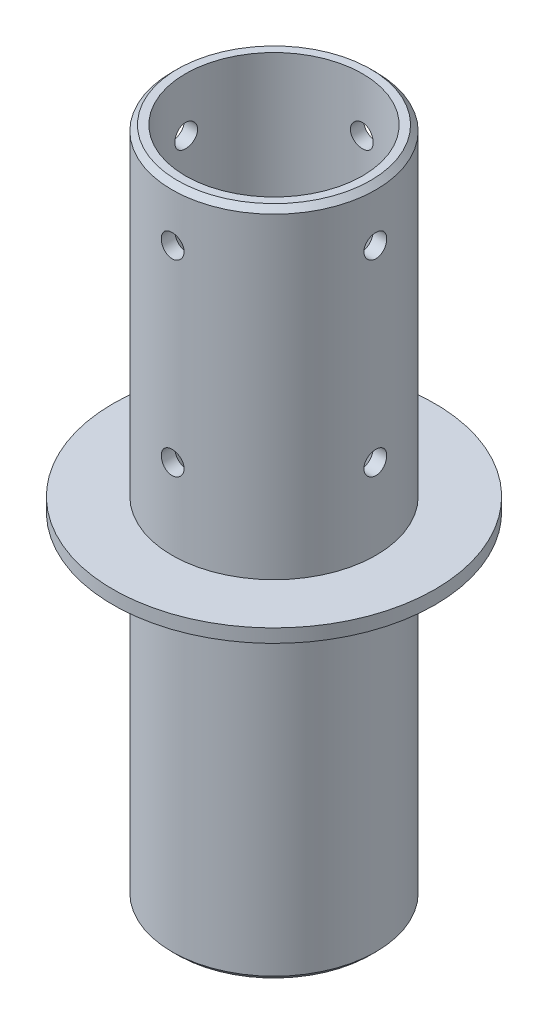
ISO-10303-21;
HEADER;
FILE_DESCRIPTION(('STEP AP214'),'2;1');
FILE_NAME('part.step','',(''),(''),'','','');
FILE_SCHEMA(('AUTOMOTIVE_DESIGN { 1 0 10303 214 1 1 1 1 }'));
ENDSEC;
DATA;
#1=APPLICATION_CONTEXT('core data for automotive mechanical design processes');
#2=APPLICATION_PROTOCOL_DEFINITION('international standard','automotive_design',2000,#1);
#3=PRODUCT_CONTEXT('',#1,'mechanical');
#4=PRODUCT('Part','Part','',(#3));
#5=PRODUCT_RELATED_PRODUCT_CATEGORY('part','',(#4));
#6=PRODUCT_DEFINITION_FORMATION('','',#4);
#7=PRODUCT_DEFINITION_CONTEXT('part definition',#1,'design');
#8=PRODUCT_DEFINITION('design','',#6,#7);
#9=PRODUCT_DEFINITION_SHAPE('','',#8);
#10=(LENGTH_UNIT() NAMED_UNIT(*) SI_UNIT(.MILLI.,.METRE.));
#11=(NAMED_UNIT(*) PLANE_ANGLE_UNIT() SI_UNIT($,.RADIAN.));
#12=(NAMED_UNIT(*) SI_UNIT($,.STERADIAN.) SOLID_ANGLE_UNIT());
#13=UNCERTAINTY_MEASURE_WITH_UNIT(LENGTH_MEASURE(1.E-05),#10,'distance_accuracy_value','');
#14=(GEOMETRIC_REPRESENTATION_CONTEXT(3) GLOBAL_UNCERTAINTY_ASSIGNED_CONTEXT((#13)) GLOBAL_UNIT_ASSIGNED_CONTEXT((#10,
#11,#12)) REPRESENTATION_CONTEXT('',''));
#15=CARTESIAN_POINT('',(0.,0.,0.));
#16=DIRECTION('',(0.,0.,1.));
#17=DIRECTION('',(1.,0.,0.));
#18=AXIS2_PLACEMENT_3D('',#15,#16,#17);
#19=CARTESIAN_POINT('',(0.,3115.53993403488,0.));
#20=DIRECTION('',(0.,1.,0.));
#21=DIRECTION('',(-1.,0.,0.));
#22=AXIS2_PLACEMENT_3D('',#19,#20,#21);
#23=CYLINDRICAL_SURFACE('',#22,38.0000000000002);
#24=CARTESIAN_POINT('',(-4.24999999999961,160.,37.7615876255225));
#25=CARTESIAN_POINT('',(-4.2499897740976,160.237922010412,37.761590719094));
#26=CARTESIAN_POINT('',(-4.22995375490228,160.475997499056,37.7638604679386));
#27=CARTESIAN_POINT('',(-4.15033507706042,160.945536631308,37.7726920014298));
#28=CARTESIAN_POINT('',(-4.09070984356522,161.176992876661,37.7792584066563));
#29=CARTESIAN_POINT('',(-3.93368044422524,161.626426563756,37.7959303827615));
#30=CARTESIAN_POINT('',(-3.83630040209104,161.844412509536,37.8060336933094));
#31=CARTESIAN_POINT('',(-3.60657446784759,162.260902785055,37.8286383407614));
#32=CARTESIAN_POINT('',(-3.47423508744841,162.459410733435,37.8411392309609));
#33=CARTESIAN_POINT('',(-3.17770685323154,162.832249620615,37.8671936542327));
#34=CARTESIAN_POINT('',(-3.01339209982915,163.006480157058,37.8807512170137));
#35=CARTESIAN_POINT('',(-2.65784754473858,163.32495261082,37.907354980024));
#36=CARTESIAN_POINT('',(-2.46661646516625,163.469193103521,37.920401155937));
#37=CARTESIAN_POINT('',(-2.06204440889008,163.723944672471,37.9445527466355));
#38=CARTESIAN_POINT('',(-1.84864650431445,163.834365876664,37.9556529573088));
#39=CARTESIAN_POINT('',(-1.4061921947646,164.017769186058,37.9746178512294));
#40=CARTESIAN_POINT('',(-1.17713626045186,164.09075241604,37.9824826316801));
#41=CARTESIAN_POINT('',(-0.71088901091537,164.196910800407,37.9940621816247));
#42=CARTESIAN_POINT('',(-0.473735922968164,164.230251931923,37.9977942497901));
#43=CARTESIAN_POINT('',(0.00282702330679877,164.25669362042,38.0007468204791));
#44=CARTESIAN_POINT('',(0.242236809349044,164.249795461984,37.9999674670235));
#45=CARTESIAN_POINT('',(0.715389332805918,164.196088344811,37.9939990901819));
#46=CARTESIAN_POINT('',(0.949152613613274,164.149457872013,37.9888297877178));
#47=CARTESIAN_POINT('',(1.40551442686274,164.017888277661,37.9746847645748));
#48=CARTESIAN_POINT('',(1.6281127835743,163.932948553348,37.9657089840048));
#49=CARTESIAN_POINT('',(2.0563841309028,163.726978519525,37.9449258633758));
#50=CARTESIAN_POINT('',(2.26201920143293,163.605870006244,37.9331123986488));
#51=CARTESIAN_POINT('',(2.65011303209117,163.331057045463,37.9079777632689));
#52=CARTESIAN_POINT('',(2.83257094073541,163.177351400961,37.8946565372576));
#53=CARTESIAN_POINT('',(3.170177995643,162.840705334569,37.8679134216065));
#54=CARTESIAN_POINT('',(3.32517221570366,162.657609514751,37.8544913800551));
#55=CARTESIAN_POINT('',(3.60225067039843,162.267917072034,37.829131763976));
#56=CARTESIAN_POINT('',(3.72433483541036,162.061320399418,37.8171941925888));
#57=CARTESIAN_POINT('',(3.93213117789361,161.630363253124,37.7961546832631));
#58=CARTESIAN_POINT('',(4.01783252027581,161.405997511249,37.7870535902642));
#59=CARTESIAN_POINT('',(4.15030129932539,160.94593571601,37.7727345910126));
#60=CARTESIAN_POINT('',(4.19707022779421,160.710240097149,37.7675165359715));
#61=CARTESIAN_POINT('',(4.25014467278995,160.235572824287,37.7615809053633));
#62=CARTESIAN_POINT('',(4.25666750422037,159.996625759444,37.760839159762));
#63=CARTESIAN_POINT('',(4.22963650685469,159.521042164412,37.763876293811));
#64=CARTESIAN_POINT('',(4.19608335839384,159.284405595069,37.7676550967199));
#65=CARTESIAN_POINT('',(4.09003519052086,158.82080159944,37.7792855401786));
#66=CARTESIAN_POINT('',(4.01764402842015,158.593810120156,37.7871263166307));
#67=CARTESIAN_POINT('',(3.83608116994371,158.155189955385,37.8059884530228));
#68=CARTESIAN_POINT('',(3.72690842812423,157.943561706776,37.8170099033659));
#69=CARTESIAN_POINT('',(3.47434153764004,157.540688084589,37.8410498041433));
#70=CARTESIAN_POINT('',(3.33080405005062,157.349533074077,37.8540765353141));
#71=CARTESIAN_POINT('',(3.01378635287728,156.993950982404,37.8806326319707));
#72=CARTESIAN_POINT('',(2.84030521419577,156.829524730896,37.8941620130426));
#73=CARTESIAN_POINT('',(2.46737899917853,156.531311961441,37.9202725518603));
#74=CARTESIAN_POINT('',(2.26781982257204,156.397667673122,37.9328491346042));
#75=CARTESIAN_POINT('',(1.84896195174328,156.165793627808,37.9555696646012));
#76=CARTESIAN_POINT('',(1.62966358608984,156.067563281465,37.9657136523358));
#77=CARTESIAN_POINT('',(1.17803820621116,155.909543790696,37.9824055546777));
#78=CARTESIAN_POINT('',(0.945740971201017,155.849670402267,37.9889613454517));
#79=CARTESIAN_POINT('',(0.474313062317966,155.769789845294,37.9977706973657));
#80=CARTESIAN_POINT('',(0.235182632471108,155.749781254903,38.0000244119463));
#81=CARTESIAN_POINT('',(-0.241730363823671,155.750221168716,37.9999753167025));
#82=CARTESIAN_POINT('',(-0.479513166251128,155.770449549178,37.997697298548));
#83=CARTESIAN_POINT('',(-0.948278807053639,155.850325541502,37.9888897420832));
#84=CARTESIAN_POINT('',(-1.17926164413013,155.909973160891,37.9823602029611));
#85=CARTESIAN_POINT('',(-1.62785658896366,156.066929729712,37.9657805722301));
#86=CARTESIAN_POINT('',(-1.84547163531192,156.164230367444,37.9557312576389));
#87=CARTESIAN_POINT('',(-2.26131770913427,156.393708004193,37.9332289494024));
#88=CARTESIAN_POINT('',(-2.45954869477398,156.525885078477,37.9207759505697));
#89=CARTESIAN_POINT('',(-2.83212663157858,156.822184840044,37.8947776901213));
#90=CARTESIAN_POINT('',(-3.00634277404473,156.986471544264,37.8812270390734));
#91=CARTESIAN_POINT('',(-3.32482535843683,157.341993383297,37.8546053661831));
#92=CARTESIAN_POINT('',(-3.46908464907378,157.533234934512,37.8415344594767));
#93=CARTESIAN_POINT('',(-3.72392919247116,157.937907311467,37.8173087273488));
#94=CARTESIAN_POINT('',(-3.83440805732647,158.15140545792,37.8061600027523));
#95=CARTESIAN_POINT('',(-4.01779477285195,158.593919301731,37.7871129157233));
#96=CARTESIAN_POINT('',(-4.09074432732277,158.822917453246,37.7792109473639));
#97=CARTESIAN_POINT('',(-4.17913261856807,159.210970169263,37.769511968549));
#98=CARTESIAN_POINT('',(-4.20567073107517,159.367557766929,37.7665547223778));
#99=CARTESIAN_POINT('',(-4.24110778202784,159.682740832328,37.7625915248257));
#100=CARTESIAN_POINT('',(-4.25000681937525,159.841336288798,37.7615855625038));
#101=CARTESIAN_POINT('',(-4.24999999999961,160.,37.7615876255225));
#102=B_SPLINE_CURVE_WITH_KNOTS('',3,(#24,#25,#26,#27,#28,#29,#30,#31,#32,#33,#34,#35,#36,#37,
#38,#39,#40,#41,#42,#43,#44,#45,#46,#47,#48,#49,#50,#51,#52,#53,#54,#55,#56,#57,#58,#59,#60,#61,
#62,#63,#64,#65,#66,#67,#68,#69,#70,#71,#72,#73,#74,#75,#76,#77,#78,#79,#80,#81,#82,#83,#84,#85,
#86,#87,#88,#89,#90,#91,#92,#93,#94,#95,#96,#97,#98,#99,#100,#101),.UNSPECIFIED.,.T.,.F.,(4,2,2,
2,2,2,2,2,2,2,2,2,2,2,2,2,2,2,2,2,2,2,2,2,2,2,2,2,2,2,2,2,2,2,2,2,2,2,4),(0.,0.713186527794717,
1.427141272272,2.14064057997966,2.85400708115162,3.57024139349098,4.2865097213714,
5.00466528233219,5.72279926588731,6.43791579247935,7.15300949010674,7.86490767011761,
8.57681705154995,9.29027699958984,10.0037631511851,10.7211542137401,11.4385467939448,
12.1561528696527,12.8737314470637,13.5874319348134,14.3011203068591,15.0129096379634,
15.7247192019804,16.4395511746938,17.1544053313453,17.872499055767,18.5905808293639,
19.307080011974,20.0235536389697,20.7361184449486,21.4486833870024,22.16109112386,
22.8735003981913,23.5896485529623,24.3059674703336,25.0245196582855,25.7422716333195,
26.2178789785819,26.6934836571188),.UNSPECIFIED.);
#103=CARTESIAN_POINT('',(-4.24999999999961,160.,37.7615876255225));
#104=VERTEX_POINT('',#103);
#105=EDGE_CURVE('E73',#104,#104,#102,.T.);
#106=ORIENTED_EDGE('',*,*,#105,.T.);
#107=EDGE_LOOP('',(#106));
#108=FACE_BOUND('',#107,.T.);
#109=CARTESIAN_POINT('',(-4.24999999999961,230.,37.7615876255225));
#110=CARTESIAN_POINT('',(-4.2499897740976,230.237922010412,37.761590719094));
#111=CARTESIAN_POINT('',(-4.22995375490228,230.475997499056,37.7638604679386));
#112=CARTESIAN_POINT('',(-4.15033507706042,230.945536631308,37.7726920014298));
#113=CARTESIAN_POINT('',(-4.09070984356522,231.176992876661,37.7792584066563));
#114=CARTESIAN_POINT('',(-3.93368044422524,231.626426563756,37.7959303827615));
#115=CARTESIAN_POINT('',(-3.83630040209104,231.844412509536,37.8060336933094));
#116=CARTESIAN_POINT('',(-3.60657446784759,232.260902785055,37.8286383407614));
#117=CARTESIAN_POINT('',(-3.47423508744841,232.459410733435,37.8411392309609));
#118=CARTESIAN_POINT('',(-3.17770685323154,232.832249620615,37.8671936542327));
#119=CARTESIAN_POINT('',(-3.01339209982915,233.006480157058,37.8807512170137));
#120=CARTESIAN_POINT('',(-2.65784754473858,233.32495261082,37.907354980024));
#121=CARTESIAN_POINT('',(-2.46661646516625,233.469193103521,37.920401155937));
#122=CARTESIAN_POINT('',(-2.06204440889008,233.723944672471,37.9445527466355));
#123=CARTESIAN_POINT('',(-1.84864650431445,233.834365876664,37.9556529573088));
#124=CARTESIAN_POINT('',(-1.4061921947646,234.017769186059,37.9746178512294));
#125=CARTESIAN_POINT('',(-1.17713626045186,234.09075241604,37.9824826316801));
#126=CARTESIAN_POINT('',(-0.71088901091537,234.196910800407,37.9940621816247));
#127=CARTESIAN_POINT('',(-0.473735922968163,234.230251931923,37.9977942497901));
#128=CARTESIAN_POINT('',(0.0028270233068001,234.25669362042,38.0007468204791));
#129=CARTESIAN_POINT('',(0.242236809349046,234.249795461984,37.9999674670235));
#130=CARTESIAN_POINT('',(0.715389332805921,234.196088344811,37.9939990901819));
#131=CARTESIAN_POINT('',(0.949152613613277,234.149457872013,37.9888297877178));
#132=CARTESIAN_POINT('',(1.40551442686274,234.017888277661,37.9746847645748));
#133=CARTESIAN_POINT('',(1.6281127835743,233.932948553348,37.9657089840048));
#134=CARTESIAN_POINT('',(2.0563841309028,233.726978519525,37.9449258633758));
#135=CARTESIAN_POINT('',(2.26201920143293,233.605870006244,37.9331123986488));
#136=CARTESIAN_POINT('',(2.65011303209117,233.331057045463,37.9079777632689));
#137=CARTESIAN_POINT('',(2.83257094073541,233.177351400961,37.8946565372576));
#138=CARTESIAN_POINT('',(3.170177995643,232.840705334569,37.8679134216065));
#139=CARTESIAN_POINT('',(3.32517221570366,232.657609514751,37.8544913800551));
#140=CARTESIAN_POINT('',(3.60225067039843,232.267917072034,37.829131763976));
#141=CARTESIAN_POINT('',(3.72433483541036,232.061320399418,37.8171941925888));
#142=CARTESIAN_POINT('',(3.93213117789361,231.630363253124,37.7961546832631));
#143=CARTESIAN_POINT('',(4.01783252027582,231.405997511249,37.7870535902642));
#144=CARTESIAN_POINT('',(4.15030129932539,230.94593571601,37.7727345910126));
#145=CARTESIAN_POINT('',(4.19707022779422,230.710240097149,37.7675165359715));
#146=CARTESIAN_POINT('',(4.25014467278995,230.235572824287,37.7615809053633));
#147=CARTESIAN_POINT('',(4.25666750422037,229.996625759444,37.760839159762));
#148=CARTESIAN_POINT('',(4.22963650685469,229.521042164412,37.763876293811));
#149=CARTESIAN_POINT('',(4.19608335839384,229.28440559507,37.7676550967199));
#150=CARTESIAN_POINT('',(4.09003519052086,228.82080159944,37.7792855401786));
#151=CARTESIAN_POINT('',(4.01764402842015,228.593810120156,37.7871263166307));
#152=CARTESIAN_POINT('',(3.8360811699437,228.155189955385,37.8059884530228));
#153=CARTESIAN_POINT('',(3.72690842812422,227.943561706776,37.8170099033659));
#154=CARTESIAN_POINT('',(3.47434153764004,227.540688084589,37.8410498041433));
#155=CARTESIAN_POINT('',(3.33080405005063,227.349533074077,37.8540765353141));
#156=CARTESIAN_POINT('',(3.01378635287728,226.993950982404,37.8806326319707));
#157=CARTESIAN_POINT('',(2.84030521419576,226.829524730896,37.8941620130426));
#158=CARTESIAN_POINT('',(2.46737899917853,226.531311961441,37.9202725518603));
#159=CARTESIAN_POINT('',(2.26781982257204,226.397667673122,37.9328491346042));
#160=CARTESIAN_POINT('',(1.84896195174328,226.165793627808,37.9555696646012));
#161=CARTESIAN_POINT('',(1.62966358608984,226.067563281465,37.9657136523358));
#162=CARTESIAN_POINT('',(1.17803820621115,225.909543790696,37.9824055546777));
#163=CARTESIAN_POINT('',(0.945740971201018,225.849670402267,37.9889613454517));
#164=CARTESIAN_POINT('',(0.474313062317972,225.769789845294,37.9977706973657));
#165=CARTESIAN_POINT('',(0.235182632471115,225.749781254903,38.0000244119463));
#166=CARTESIAN_POINT('',(-0.241730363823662,225.750221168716,37.9999753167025));
#167=CARTESIAN_POINT('',(-0.479513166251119,225.770449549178,37.997697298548));
#168=CARTESIAN_POINT('',(-0.948278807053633,225.850325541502,37.9888897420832));
#169=CARTESIAN_POINT('',(-1.17926164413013,225.909973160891,37.9823602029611));
#170=CARTESIAN_POINT('',(-1.62785658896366,226.066929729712,37.9657805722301));
#171=CARTESIAN_POINT('',(-1.84547163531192,226.164230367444,37.9557312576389));
#172=CARTESIAN_POINT('',(-2.26131770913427,226.393708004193,37.9332289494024));
#173=CARTESIAN_POINT('',(-2.45954869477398,226.525885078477,37.9207759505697));
#174=CARTESIAN_POINT('',(-2.83212663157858,226.822184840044,37.8947776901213));
#175=CARTESIAN_POINT('',(-3.00634277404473,226.986471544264,37.8812270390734));
#176=CARTESIAN_POINT('',(-3.32482535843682,227.341993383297,37.8546053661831));
#177=CARTESIAN_POINT('',(-3.46908464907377,227.533234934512,37.8415344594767));
#178=CARTESIAN_POINT('',(-3.72392919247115,227.937907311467,37.8173087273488));
#179=CARTESIAN_POINT('',(-3.83440805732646,228.15140545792,37.8061600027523));
#180=CARTESIAN_POINT('',(-4.01779477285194,228.593919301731,37.7871129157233));
#181=CARTESIAN_POINT('',(-4.09074432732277,228.822917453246,37.7792109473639));
#182=CARTESIAN_POINT('',(-4.17913261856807,229.210970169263,37.769511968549));
#183=CARTESIAN_POINT('',(-4.20567073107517,229.367557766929,37.7665547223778));
#184=CARTESIAN_POINT('',(-4.24110778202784,229.682740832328,37.7625915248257));
#185=CARTESIAN_POINT('',(-4.25000681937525,229.841336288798,37.7615855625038));
#186=CARTESIAN_POINT('',(-4.24999999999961,230.,37.7615876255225));
#187=B_SPLINE_CURVE_WITH_KNOTS('',3,(#109,#110,#111,#112,#113,#114,#115,#116,#117,#118,#119,
#120,#121,#122,#123,#124,#125,#126,#127,#128,#129,#130,#131,#132,#133,#134,#135,#136,#137,#138,
#139,#140,#141,#142,#143,#144,#145,#146,#147,#148,#149,#150,#151,#152,#153,#154,#155,#156,#157,
#158,#159,#160,#161,#162,#163,#164,#165,#166,#167,#168,#169,#170,#171,#172,#173,#174,#175,#176,
#177,#178,#179,#180,#181,#182,#183,#184,#185,#186),.UNSPECIFIED.,.T.,.F.,(4,2,2,2,2,2,2,2,2,2,2,
2,2,2,2,2,2,2,2,2,2,2,2,2,2,2,2,2,2,2,2,2,2,2,2,2,2,2,4),(0.,0.713186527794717,1.427141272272,
2.14064057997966,2.85400708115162,3.57024139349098,4.2865097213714,5.00466528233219,
5.72279926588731,6.43791579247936,7.15300949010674,7.86490767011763,8.57681705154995,
9.29027699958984,10.0037631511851,10.7211542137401,11.4385467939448,12.1561528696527,
12.8737314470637,13.5874319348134,14.3011203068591,15.0129096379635,15.7247192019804,
16.4395511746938,17.1544053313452,17.872499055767,18.5905808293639,19.307080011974,
20.0235536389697,20.7361184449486,21.4486833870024,22.16109112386,22.8735003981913,
23.5896485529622,24.3059674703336,25.0245196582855,25.7422716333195,26.2178789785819,
26.6934836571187),.UNSPECIFIED.);
#188=CARTESIAN_POINT('',(-4.24999999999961,230.,37.7615876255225));
#189=VERTEX_POINT('',#188);
#190=EDGE_CURVE('E94',#189,#189,#187,.T.);
#191=ORIENTED_EDGE('',*,*,#190,.T.);
#192=EDGE_LOOP('',(#191));
#193=FACE_BOUND('',#192,.T.);
#194=CARTESIAN_POINT('',(37.7615876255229,160.,4.24999999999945));
#195=CARTESIAN_POINT('',(37.7615907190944,160.237922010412,4.24998977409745));
#196=CARTESIAN_POINT('',(37.763860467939,160.475997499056,4.22995375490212));
#197=CARTESIAN_POINT('',(37.7726920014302,160.945536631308,4.15033507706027));
#198=CARTESIAN_POINT('',(37.7792584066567,161.176992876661,4.09070984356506));
#199=CARTESIAN_POINT('',(37.7959303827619,161.626426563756,3.93368044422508));
#200=CARTESIAN_POINT('',(37.8060336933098,161.844412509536,3.83630040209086));
#201=CARTESIAN_POINT('',(37.8286383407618,162.260902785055,3.6065744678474));
#202=CARTESIAN_POINT('',(37.8411392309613,162.459410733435,3.47423508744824));
#203=CARTESIAN_POINT('',(37.8671936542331,162.832249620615,3.17770685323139));
#204=CARTESIAN_POINT('',(37.8807512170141,163.006480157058,3.013392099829));
#205=CARTESIAN_POINT('',(37.9073549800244,163.32495261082,2.65784754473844));
#206=CARTESIAN_POINT('',(37.9204011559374,163.469193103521,2.4666164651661));
#207=CARTESIAN_POINT('',(37.9445527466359,163.723944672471,2.06204440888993));
#208=CARTESIAN_POINT('',(37.9556529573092,163.834365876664,1.8486465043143));
#209=CARTESIAN_POINT('',(37.9746178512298,164.017769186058,1.40619219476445));
#210=CARTESIAN_POINT('',(37.9824826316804,164.09075241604,1.17713626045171));
#211=CARTESIAN_POINT('',(37.994062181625,164.196910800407,0.710889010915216));
#212=CARTESIAN_POINT('',(37.9977942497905,164.230251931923,0.473735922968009));
#213=CARTESIAN_POINT('',(38.0007468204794,164.25669362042,-0.00282702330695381));
#214=CARTESIAN_POINT('',(37.9999674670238,164.249795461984,-0.2422368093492));
#215=CARTESIAN_POINT('',(37.9939990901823,164.196088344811,-0.715389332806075));
#216=CARTESIAN_POINT('',(37.9888297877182,164.149457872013,-0.949152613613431));
#217=CARTESIAN_POINT('',(37.9746847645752,164.017888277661,-1.40551442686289));
#218=CARTESIAN_POINT('',(37.9657089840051,163.932948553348,-1.62811278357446));
#219=CARTESIAN_POINT('',(37.9449258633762,163.726978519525,-2.05638413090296));
#220=CARTESIAN_POINT('',(37.9331123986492,163.605870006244,-2.26201920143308));
#221=CARTESIAN_POINT('',(37.9079777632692,163.331057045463,-2.65011303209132));
#222=CARTESIAN_POINT('',(37.894656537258,163.177351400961,-2.83257094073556));
#223=CARTESIAN_POINT('',(37.8679134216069,162.840705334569,-3.17017799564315));
#224=CARTESIAN_POINT('',(37.8544913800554,162.657609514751,-3.3251722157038));
#225=CARTESIAN_POINT('',(37.8291317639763,162.267917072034,-3.60225067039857));
#226=CARTESIAN_POINT('',(37.8171941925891,162.061320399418,-3.72433483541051));
#227=CARTESIAN_POINT('',(37.7961546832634,161.630363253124,-3.93213117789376));
#228=CARTESIAN_POINT('',(37.7870535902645,161.405997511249,-4.01783252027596));
#229=CARTESIAN_POINT('',(37.7727345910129,160.94593571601,-4.15030129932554));
#230=CARTESIAN_POINT('',(37.7675165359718,160.710240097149,-4.19707022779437));
#231=CARTESIAN_POINT('',(37.7615809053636,160.235572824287,-4.2501446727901));
#232=CARTESIAN_POINT('',(37.7608391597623,159.996625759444,-4.25666750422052));
#233=CARTESIAN_POINT('',(37.7638762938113,159.521042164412,-4.22963650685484));
#234=CARTESIAN_POINT('',(37.7676550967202,159.284405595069,-4.196083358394));
#235=CARTESIAN_POINT('',(37.7792855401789,158.82080159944,-4.09003519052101));
#236=CARTESIAN_POINT('',(37.787126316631,158.593810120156,-4.0176440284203));
#237=CARTESIAN_POINT('',(37.8059884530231,158.155189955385,-3.83608116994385));
#238=CARTESIAN_POINT('',(37.8170099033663,157.943561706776,-3.72690842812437));
#239=CARTESIAN_POINT('',(37.8410498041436,157.540688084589,-3.47434153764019));
#240=CARTESIAN_POINT('',(37.8540765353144,157.349533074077,-3.33080405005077));
#241=CARTESIAN_POINT('',(37.880632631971,156.993950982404,-3.01378635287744));
#242=CARTESIAN_POINT('',(37.8941620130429,156.829524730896,-2.84030521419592));
#243=CARTESIAN_POINT('',(37.9202725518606,156.531311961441,-2.46737899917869));
#244=CARTESIAN_POINT('',(37.9328491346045,156.397667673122,-2.26781982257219));
#245=CARTESIAN_POINT('',(37.9555696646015,156.165793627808,-1.84896195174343));
#246=CARTESIAN_POINT('',(37.9657136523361,156.067563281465,-1.62966358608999));
#247=CARTESIAN_POINT('',(37.9824055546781,155.909543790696,-1.17803820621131));
#248=CARTESIAN_POINT('',(37.9889613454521,155.849670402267,-0.945740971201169));
#249=CARTESIAN_POINT('',(37.9977706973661,155.769789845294,-0.474313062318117));
#250=CARTESIAN_POINT('',(38.0000244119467,155.749781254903,-0.235182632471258));
#251=CARTESIAN_POINT('',(37.9999753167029,155.750221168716,0.24173036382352));
#252=CARTESIAN_POINT('',(37.9976972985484,155.770449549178,0.479513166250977));
#253=CARTESIAN_POINT('',(37.9888897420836,155.850325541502,0.948278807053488));
#254=CARTESIAN_POINT('',(37.9823602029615,155.909973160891,1.17926164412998));
#255=CARTESIAN_POINT('',(37.9657805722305,156.066929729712,1.62785658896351));
#256=CARTESIAN_POINT('',(37.9557312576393,156.164230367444,1.84547163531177));
#257=CARTESIAN_POINT('',(37.9332289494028,156.393708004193,2.26131770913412));
#258=CARTESIAN_POINT('',(37.9207759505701,156.525885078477,2.45954869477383));
#259=CARTESIAN_POINT('',(37.8947776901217,156.822184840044,2.83212663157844));
#260=CARTESIAN_POINT('',(37.8812270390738,156.986471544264,3.00634277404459));
#261=CARTESIAN_POINT('',(37.8546053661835,157.341993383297,3.32482535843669));
#262=CARTESIAN_POINT('',(37.8415344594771,157.533234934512,3.46908464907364));
#263=CARTESIAN_POINT('',(37.8173087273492,157.937907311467,3.72392919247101));
#264=CARTESIAN_POINT('',(37.8061600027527,158.15140545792,3.83440805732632));
#265=CARTESIAN_POINT('',(37.7871129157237,158.593919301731,4.0177947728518));
#266=CARTESIAN_POINT('',(37.7792109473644,158.822917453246,4.09074432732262));
#267=CARTESIAN_POINT('',(37.7695119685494,159.210970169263,4.17913261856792));
#268=CARTESIAN_POINT('',(37.7665547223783,159.367557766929,4.20567073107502));
#269=CARTESIAN_POINT('',(37.7625915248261,159.682740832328,4.24110778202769));
#270=CARTESIAN_POINT('',(37.7615855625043,159.841336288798,4.2500068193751));
#271=CARTESIAN_POINT('',(37.7615876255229,160.,4.24999999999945));
#272=B_SPLINE_CURVE_WITH_KNOTS('',3,(#194,#195,#196,#197,#198,#199,#200,#201,#202,#203,#204,
#205,#206,#207,#208,#209,#210,#211,#212,#213,#214,#215,#216,#217,#218,#219,#220,#221,#222,#223,
#224,#225,#226,#227,#228,#229,#230,#231,#232,#233,#234,#235,#236,#237,#238,#239,#240,#241,#242,
#243,#244,#245,#246,#247,#248,#249,#250,#251,#252,#253,#254,#255,#256,#257,#258,#259,#260,#261,
#262,#263,#264,#265,#266,#267,#268,#269,#270,#271),.UNSPECIFIED.,.T.,.F.,(4,2,2,2,2,2,2,2,2,2,2,
2,2,2,2,2,2,2,2,2,2,2,2,2,2,2,2,2,2,2,2,2,2,2,2,2,2,2,4),(0.,0.713186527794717,1.427141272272,
2.14064057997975,2.85400708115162,3.57024139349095,4.2865097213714,5.00466528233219,
5.7227992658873,6.43791579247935,7.15300949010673,7.86490767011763,8.57681705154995,
9.29027699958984,10.0037631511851,10.72115421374,11.4385467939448,12.1561528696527,
12.8737314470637,13.5874319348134,14.3011203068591,15.0129096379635,15.7247192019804,
16.4395511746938,17.1544053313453,17.872499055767,18.5905808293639,19.307080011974,
20.0235536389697,20.7361184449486,21.4486833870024,22.16109112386,22.8735003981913,
23.5896485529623,24.3059674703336,25.0245196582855,25.7422716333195,26.2178789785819,
26.6934836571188),.UNSPECIFIED.);
#273=CARTESIAN_POINT('',(37.7615876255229,160.,4.24999999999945));
#274=VERTEX_POINT('',#273);
#275=EDGE_CURVE('E288',#274,#274,#272,.T.);
#276=ORIENTED_EDGE('',*,*,#275,.T.);
#277=EDGE_LOOP('',(#276));
#278=FACE_BOUND('',#277,.T.);
#279=CARTESIAN_POINT('',(37.7615876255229,230.,4.24999999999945));
#280=CARTESIAN_POINT('',(37.7615907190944,230.237922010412,4.24998977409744));
#281=CARTESIAN_POINT('',(37.763860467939,230.475997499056,4.22995375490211));
#282=CARTESIAN_POINT('',(37.7726920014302,230.945536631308,4.15033507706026));
#283=CARTESIAN_POINT('',(37.7792584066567,231.176992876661,4.09070984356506));
#284=CARTESIAN_POINT('',(37.7959303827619,231.626426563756,3.93368044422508));
#285=CARTESIAN_POINT('',(37.8060336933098,231.844412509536,3.83630040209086));
#286=CARTESIAN_POINT('',(37.8286383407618,232.260902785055,3.60657446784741));
#287=CARTESIAN_POINT('',(37.8411392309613,232.459410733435,3.47423508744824));
#288=CARTESIAN_POINT('',(37.8671936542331,232.832249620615,3.17770685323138));
#289=CARTESIAN_POINT('',(37.8807512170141,233.006480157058,3.01339209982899));
#290=CARTESIAN_POINT('',(37.9073549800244,233.32495261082,2.65784754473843));
#291=CARTESIAN_POINT('',(37.9204011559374,233.469193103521,2.46661646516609));
#292=CARTESIAN_POINT('',(37.9445527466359,233.723944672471,2.06204440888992));
#293=CARTESIAN_POINT('',(37.9556529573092,233.834365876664,1.84864650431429));
#294=CARTESIAN_POINT('',(37.9746178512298,234.017769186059,1.40619219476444));
#295=CARTESIAN_POINT('',(37.9824826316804,234.09075241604,1.1771362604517));
#296=CARTESIAN_POINT('',(37.994062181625,234.196910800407,0.710889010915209));
#297=CARTESIAN_POINT('',(37.9977942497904,234.230251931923,0.473735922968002));
#298=CARTESIAN_POINT('',(38.0007468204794,234.25669362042,-0.00282702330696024));
#299=CARTESIAN_POINT('',(37.9999674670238,234.249795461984,-0.242236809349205));
#300=CARTESIAN_POINT('',(37.9939990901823,234.196088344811,-0.71538933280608));
#301=CARTESIAN_POINT('',(37.9888297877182,234.149457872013,-0.949152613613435));
#302=CARTESIAN_POINT('',(37.9746847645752,234.017888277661,-1.4055144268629));
#303=CARTESIAN_POINT('',(37.9657089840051,233.932948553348,-1.62811278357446));
#304=CARTESIAN_POINT('',(37.9449258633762,233.726978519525,-2.05638413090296));
#305=CARTESIAN_POINT('',(37.9331123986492,233.605870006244,-2.26201920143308));
#306=CARTESIAN_POINT('',(37.9079777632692,233.331057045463,-2.65011303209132));
#307=CARTESIAN_POINT('',(37.894656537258,233.177351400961,-2.83257094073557));
#308=CARTESIAN_POINT('',(37.8679134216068,232.840705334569,-3.17017799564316));
#309=CARTESIAN_POINT('',(37.8544913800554,232.657609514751,-3.32517221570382));
#310=CARTESIAN_POINT('',(37.8291317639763,232.267917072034,-3.60225067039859));
#311=CARTESIAN_POINT('',(37.8171941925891,232.061320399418,-3.72433483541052));
#312=CARTESIAN_POINT('',(37.7961546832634,231.630363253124,-3.93213117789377));
#313=CARTESIAN_POINT('',(37.7870535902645,231.405997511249,-4.01783252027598));
#314=CARTESIAN_POINT('',(37.7727345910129,230.94593571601,-4.15030129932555));
#315=CARTESIAN_POINT('',(37.7675165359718,230.710240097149,-4.19707022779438));
#316=CARTESIAN_POINT('',(37.7615809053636,230.235572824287,-4.25014467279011));
#317=CARTESIAN_POINT('',(37.7608391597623,229.996625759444,-4.25666750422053));
#318=CARTESIAN_POINT('',(37.7638762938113,229.521042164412,-4.22963650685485));
#319=CARTESIAN_POINT('',(37.7676550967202,229.28440559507,-4.196083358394));
#320=CARTESIAN_POINT('',(37.7792855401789,228.82080159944,-4.09003519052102));
#321=CARTESIAN_POINT('',(37.787126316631,228.593810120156,-4.01764402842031));
#322=CARTESIAN_POINT('',(37.8059884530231,228.155189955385,-3.83608116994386));
#323=CARTESIAN_POINT('',(37.8170099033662,227.943561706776,-3.72690842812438));
#324=CARTESIAN_POINT('',(37.8410498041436,227.540688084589,-3.4743415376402));
#325=CARTESIAN_POINT('',(37.8540765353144,227.349533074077,-3.33080405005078));
#326=CARTESIAN_POINT('',(37.880632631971,226.993950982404,-3.01378635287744));
#327=CARTESIAN_POINT('',(37.8941620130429,226.829524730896,-2.84030521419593));
#328=CARTESIAN_POINT('',(37.9202725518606,226.531311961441,-2.46737899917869));
#329=CARTESIAN_POINT('',(37.9328491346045,226.397667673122,-2.2678198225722));
#330=CARTESIAN_POINT('',(37.9555696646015,226.165793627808,-1.84896195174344));
#331=CARTESIAN_POINT('',(37.9657136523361,226.067563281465,-1.62966358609));
#332=CARTESIAN_POINT('',(37.982405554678,225.909543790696,-1.17803820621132));
#333=CARTESIAN_POINT('',(37.9889613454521,225.849670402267,-0.945740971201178));
#334=CARTESIAN_POINT('',(37.997770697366,225.769789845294,-0.474313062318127));
#335=CARTESIAN_POINT('',(38.0000244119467,225.749781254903,-0.235182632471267));
#336=CARTESIAN_POINT('',(37.9999753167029,225.750221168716,0.24173036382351));
#337=CARTESIAN_POINT('',(37.9976972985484,225.770449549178,0.479513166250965));
#338=CARTESIAN_POINT('',(37.9888897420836,225.850325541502,0.948278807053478));
#339=CARTESIAN_POINT('',(37.9823602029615,225.909973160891,1.17926164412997));
#340=CARTESIAN_POINT('',(37.9657805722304,226.066929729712,1.6278565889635));
#341=CARTESIAN_POINT('',(37.9557312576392,226.164230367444,1.84547163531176));
#342=CARTESIAN_POINT('',(37.9332289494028,226.393708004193,2.26131770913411));
#343=CARTESIAN_POINT('',(37.9207759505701,226.525885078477,2.45954869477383));
#344=CARTESIAN_POINT('',(37.8947776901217,226.822184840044,2.83212663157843));
#345=CARTESIAN_POINT('',(37.8812270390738,226.986471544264,3.00634277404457));
#346=CARTESIAN_POINT('',(37.8546053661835,227.341993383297,3.32482535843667));
#347=CARTESIAN_POINT('',(37.8415344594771,227.533234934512,3.46908464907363));
#348=CARTESIAN_POINT('',(37.8173087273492,227.937907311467,3.723929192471));
#349=CARTESIAN_POINT('',(37.8061600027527,228.15140545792,3.83440805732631));
#350=CARTESIAN_POINT('',(37.7871129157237,228.593919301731,4.01779477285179));
#351=CARTESIAN_POINT('',(37.7792109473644,228.822917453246,4.09074432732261));
#352=CARTESIAN_POINT('',(37.7695119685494,229.210970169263,4.17913261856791));
#353=CARTESIAN_POINT('',(37.7665547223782,229.367557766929,4.20567073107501));
#354=CARTESIAN_POINT('',(37.7625915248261,229.682740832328,4.24110778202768));
#355=CARTESIAN_POINT('',(37.7615855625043,229.841336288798,4.25000681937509));
#356=CARTESIAN_POINT('',(37.7615876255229,230.,4.24999999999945));
#357=B_SPLINE_CURVE_WITH_KNOTS('',3,(#279,#280,#281,#282,#283,#284,#285,#286,#287,#288,#289,
#290,#291,#292,#293,#294,#295,#296,#297,#298,#299,#300,#301,#302,#303,#304,#305,#306,#307,#308,
#309,#310,#311,#312,#313,#314,#315,#316,#317,#318,#319,#320,#321,#322,#323,#324,#325,#326,#327,
#328,#329,#330,#331,#332,#333,#334,#335,#336,#337,#338,#339,#340,#341,#342,#343,#344,#345,#346,
#347,#348,#349,#350,#351,#352,#353,#354,#355,#356),.UNSPECIFIED.,.T.,.F.,(4,2,2,2,2,2,2,2,2,2,2,
2,2,2,2,2,2,2,2,2,2,2,2,2,2,2,2,2,2,2,2,2,2,2,2,2,2,2,4),(0.,0.713186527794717,1.427141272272,
2.14064057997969,2.85400708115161,3.57024139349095,4.2865097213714,5.00466528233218,
5.7227992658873,6.43791579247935,7.15300949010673,7.86490767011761,8.57681705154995,
9.29027699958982,10.0037631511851,10.7211542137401,11.4385467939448,12.1561528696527,
12.8737314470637,13.5874319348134,14.3011203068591,15.0129096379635,15.7247192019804,
16.4395511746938,17.1544053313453,17.872499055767,18.5905808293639,19.307080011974,
20.0235536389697,20.7361184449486,21.4486833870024,22.16109112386,22.8735003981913,
23.5896485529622,24.3059674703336,25.0245196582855,25.7422716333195,26.2178789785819,
26.6934836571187),.UNSPECIFIED.);
#358=CARTESIAN_POINT('',(37.7615876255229,230.,4.24999999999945));
#359=VERTEX_POINT('',#358);
#360=EDGE_CURVE('E264',#359,#359,#357,.T.);
#361=ORIENTED_EDGE('',*,*,#360,.T.);
#362=EDGE_LOOP('',(#361));
#363=FACE_BOUND('',#362,.T.);
#364=CARTESIAN_POINT('',(4.24999999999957,160.,-37.7615876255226));
#365=CARTESIAN_POINT('',(4.24998977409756,160.237922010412,-37.7615907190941));
#366=CARTESIAN_POINT('',(4.22995375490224,160.475997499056,-37.7638604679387));
#367=CARTESIAN_POINT('',(4.15033507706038,160.945536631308,-37.7726920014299));
#368=CARTESIAN_POINT('',(4.09070984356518,161.176992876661,-37.7792584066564));
#369=CARTESIAN_POINT('',(3.9336804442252,161.626426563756,-37.7959303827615));
#370=CARTESIAN_POINT('',(3.836300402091,161.844412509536,-37.8060336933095));
#371=CARTESIAN_POINT('',(3.60657446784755,162.260902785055,-37.8286383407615));
#372=CARTESIAN_POINT('',(3.47423508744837,162.459410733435,-37.841139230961));
#373=CARTESIAN_POINT('',(3.1777068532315,162.832249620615,-37.8671936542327));
#374=CARTESIAN_POINT('',(3.01339209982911,163.006480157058,-37.8807512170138));
#375=CARTESIAN_POINT('',(2.65784754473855,163.32495261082,-37.9073549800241));
#376=CARTESIAN_POINT('',(2.46661646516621,163.469193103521,-37.9204011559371));
#377=CARTESIAN_POINT('',(2.06204440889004,163.723944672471,-37.9445527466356));
#378=CARTESIAN_POINT('',(1.84864650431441,163.834365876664,-37.9556529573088));
#379=CARTESIAN_POINT('',(1.40619219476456,164.017769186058,-37.9746178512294));
#380=CARTESIAN_POINT('',(1.17713626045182,164.09075241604,-37.9824826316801));
#381=CARTESIAN_POINT('',(0.71088901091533,164.196910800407,-37.9940621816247));
#382=CARTESIAN_POINT('',(0.473735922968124,164.230251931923,-37.9977942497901));
#383=CARTESIAN_POINT('',(-0.00282702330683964,164.25669362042,-38.0007468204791));
#384=CARTESIAN_POINT('',(-0.242236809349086,164.249795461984,-37.9999674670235));
#385=CARTESIAN_POINT('',(-0.715389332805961,164.196088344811,-37.9939990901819));
#386=CARTESIAN_POINT('',(-0.949152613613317,164.149457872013,-37.9888297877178));
#387=CARTESIAN_POINT('',(-1.40551442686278,164.017888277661,-37.9746847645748));
#388=CARTESIAN_POINT('',(-1.62811278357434,163.932948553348,-37.9657089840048));
#389=CARTESIAN_POINT('',(-2.05638413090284,163.726978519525,-37.9449258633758));
#390=CARTESIAN_POINT('',(-2.26201920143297,163.605870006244,-37.9331123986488));
#391=CARTESIAN_POINT('',(-2.6501130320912,163.331057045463,-37.9079777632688));
#392=CARTESIAN_POINT('',(-2.83257094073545,163.177351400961,-37.8946565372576));
#393=CARTESIAN_POINT('',(-3.17017799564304,162.840705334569,-37.8679134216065));
#394=CARTESIAN_POINT('',(-3.32517221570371,162.657609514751,-37.854491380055));
#395=CARTESIAN_POINT('',(-3.60225067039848,162.267917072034,-37.8291317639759));
#396=CARTESIAN_POINT('',(-3.7243348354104,162.061320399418,-37.8171941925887));
#397=CARTESIAN_POINT('',(-3.93213117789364,161.630363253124,-37.796154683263));
#398=CARTESIAN_POINT('',(-4.01783252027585,161.405997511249,-37.7870535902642));
#399=CARTESIAN_POINT('',(-4.15030129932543,160.94593571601,-37.7727345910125));
#400=CARTESIAN_POINT('',(-4.19707022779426,160.710240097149,-37.7675165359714));
#401=CARTESIAN_POINT('',(-4.25014467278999,160.235572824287,-37.7615809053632));
#402=CARTESIAN_POINT('',(-4.25666750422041,159.996625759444,-37.7608391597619));
#403=CARTESIAN_POINT('',(-4.22963650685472,159.521042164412,-37.7638762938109));
#404=CARTESIAN_POINT('',(-4.19608335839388,159.284405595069,-37.7676550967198));
#405=CARTESIAN_POINT('',(-4.0900351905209,158.82080159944,-37.7792855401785));
#406=CARTESIAN_POINT('',(-4.01764402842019,158.593810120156,-37.7871263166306));
#407=CARTESIAN_POINT('',(-3.83608116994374,158.155189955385,-37.8059884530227));
#408=CARTESIAN_POINT('',(-3.72690842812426,157.943561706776,-37.8170099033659));
#409=CARTESIAN_POINT('',(-3.47434153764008,157.540688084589,-37.8410498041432));
#410=CARTESIAN_POINT('',(-3.33080405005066,157.349533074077,-37.854076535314));
#411=CARTESIAN_POINT('',(-3.01378635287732,156.993950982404,-37.8806326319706));
#412=CARTESIAN_POINT('',(-2.8403052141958,156.829524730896,-37.8941620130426));
#413=CARTESIAN_POINT('',(-2.46737899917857,156.531311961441,-37.9202725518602));
#414=CARTESIAN_POINT('',(-2.26781982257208,156.397667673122,-37.9328491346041));
#415=CARTESIAN_POINT('',(-1.84896195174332,156.165793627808,-37.9555696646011));
#416=CARTESIAN_POINT('',(-1.62966358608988,156.067563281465,-37.9657136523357));
#417=CARTESIAN_POINT('',(-1.17803820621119,155.909543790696,-37.9824055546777));
#418=CARTESIAN_POINT('',(-0.945740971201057,155.849670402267,-37.9889613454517));
#419=CARTESIAN_POINT('',(-0.474313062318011,155.769789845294,-37.9977706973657));
#420=CARTESIAN_POINT('',(-0.235182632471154,155.749781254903,-38.0000244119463));
#421=CARTESIAN_POINT('',(0.241730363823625,155.750221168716,-37.9999753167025));
#422=CARTESIAN_POINT('',(0.479513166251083,155.770449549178,-37.997697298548));
#423=CARTESIAN_POINT('',(0.948278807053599,155.850325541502,-37.9888897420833));
#424=CARTESIAN_POINT('',(1.17926164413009,155.909973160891,-37.9823602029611));
#425=CARTESIAN_POINT('',(1.62785658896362,156.066929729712,-37.9657805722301));
#426=CARTESIAN_POINT('',(1.84547163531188,156.164230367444,-37.9557312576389));
#427=CARTESIAN_POINT('',(2.26131770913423,156.393708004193,-37.9332289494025));
#428=CARTESIAN_POINT('',(2.45954869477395,156.525885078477,-37.9207759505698));
#429=CARTESIAN_POINT('',(2.83212663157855,156.822184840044,-37.8947776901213));
#430=CARTESIAN_POINT('',(3.00634277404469,156.986471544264,-37.8812270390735));
#431=CARTESIAN_POINT('',(3.32482535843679,157.341993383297,-37.8546053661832));
#432=CARTESIAN_POINT('',(3.46908464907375,157.533234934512,-37.8415344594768));
#433=CARTESIAN_POINT('',(3.72392919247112,157.937907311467,-37.8173087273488));
#434=CARTESIAN_POINT('',(3.83440805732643,158.15140545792,-37.8061600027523));
#435=CARTESIAN_POINT('',(4.01779477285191,158.593919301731,-37.7871129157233));
#436=CARTESIAN_POINT('',(4.09074432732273,158.822917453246,-37.779210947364));
#437=CARTESIAN_POINT('',(4.17913261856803,159.210970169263,-37.7695119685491));
#438=CARTESIAN_POINT('',(4.20567073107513,159.367557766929,-37.7665547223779));
#439=CARTESIAN_POINT('',(4.2411077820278,159.682740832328,-37.7625915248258));
#440=CARTESIAN_POINT('',(4.25000681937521,159.841336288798,-37.7615855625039));
#441=CARTESIAN_POINT('',(4.24999999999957,160.,-37.7615876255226));
#442=B_SPLINE_CURVE_WITH_KNOTS('',3,(#364,#365,#366,#367,#368,#369,#370,#371,#372,#373,#374,
#375,#376,#377,#378,#379,#380,#381,#382,#383,#384,#385,#386,#387,#388,#389,#390,#391,#392,#393,
#394,#395,#396,#397,#398,#399,#400,#401,#402,#403,#404,#405,#406,#407,#408,#409,#410,#411,#412,
#413,#414,#415,#416,#417,#418,#419,#420,#421,#422,#423,#424,#425,#426,#427,#428,#429,#430,#431,
#432,#433,#434,#435,#436,#437,#438,#439,#440,#441),.UNSPECIFIED.,.T.,.F.,(4,2,2,2,2,2,2,2,2,2,2,
2,2,2,2,2,2,2,2,2,2,2,2,2,2,2,2,2,2,2,2,2,2,2,2,2,2,2,4),(0.,0.713186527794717,1.427141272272,
2.14064057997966,2.85400708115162,3.57024139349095,4.2865097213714,5.00466528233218,
5.7227992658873,6.43791579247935,7.15300949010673,7.86490767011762,8.57681705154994,
9.29027699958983,10.0037631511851,10.7211542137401,11.4385467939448,12.1561528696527,
12.8737314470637,13.5874319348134,14.3011203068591,15.0129096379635,15.7247192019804,
16.4395511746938,17.1544053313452,17.872499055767,18.5905808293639,19.307080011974,
20.0235536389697,20.7361184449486,21.4486833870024,22.16109112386,22.8735003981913,
23.5896485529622,24.3059674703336,25.0245196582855,25.7422716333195,26.2178789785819,
26.6934836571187),.UNSPECIFIED.);
#443=CARTESIAN_POINT('',(4.24999999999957,160.,-37.7615876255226));
#444=VERTEX_POINT('',#443);
#445=EDGE_CURVE('E236',#444,#444,#442,.T.);
#446=ORIENTED_EDGE('',*,*,#445,.T.);
#447=EDGE_LOOP('',(#446));
#448=FACE_BOUND('',#447,.T.);
#449=CARTESIAN_POINT('',(4.24999999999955,230.,-37.7615876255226));
#450=CARTESIAN_POINT('',(4.24998977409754,230.237922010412,-37.7615907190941));
#451=CARTESIAN_POINT('',(4.22995375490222,230.475997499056,-37.7638604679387));
#452=CARTESIAN_POINT('',(4.15033507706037,230.945536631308,-37.7726920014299));
#453=CARTESIAN_POINT('',(4.09070984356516,231.176992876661,-37.7792584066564));
#454=CARTESIAN_POINT('',(3.93368044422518,231.626426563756,-37.7959303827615));
#455=CARTESIAN_POINT('',(3.83630040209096,231.844412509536,-37.8060336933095));
#456=CARTESIAN_POINT('',(3.60657446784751,232.260902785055,-37.8286383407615));
#457=CARTESIAN_POINT('',(3.47423508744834,232.459410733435,-37.841139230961));
#458=CARTESIAN_POINT('',(3.17770685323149,232.832249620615,-37.8671936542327));
#459=CARTESIAN_POINT('',(3.0133920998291,233.006480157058,-37.8807512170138));
#460=CARTESIAN_POINT('',(2.65784754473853,233.32495261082,-37.9073549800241));
#461=CARTESIAN_POINT('',(2.4666164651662,233.469193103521,-37.9204011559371));
#462=CARTESIAN_POINT('',(2.06204440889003,233.723944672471,-37.9445527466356));
#463=CARTESIAN_POINT('',(1.8486465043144,233.834365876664,-37.9556529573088));
#464=CARTESIAN_POINT('',(1.40619219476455,234.017769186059,-37.9746178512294));
#465=CARTESIAN_POINT('',(1.17713626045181,234.09075241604,-37.9824826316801));
#466=CARTESIAN_POINT('',(0.710889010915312,234.196910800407,-37.9940621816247));
#467=CARTESIAN_POINT('',(0.473735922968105,234.230251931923,-37.9977942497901));
#468=CARTESIAN_POINT('',(-0.00282702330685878,234.25669362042,-38.0007468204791));
#469=CARTESIAN_POINT('',(-0.242236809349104,234.249795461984,-37.9999674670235));
#470=CARTESIAN_POINT('',(-0.715389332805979,234.196088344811,-37.9939990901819));
#471=CARTESIAN_POINT('',(-0.949152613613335,234.149457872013,-37.9888297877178));
#472=CARTESIAN_POINT('',(-1.4055144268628,234.017888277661,-37.9746847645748));
#473=CARTESIAN_POINT('',(-1.62811278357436,233.932948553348,-37.9657089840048));
#474=CARTESIAN_POINT('',(-2.05638413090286,233.726978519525,-37.9449258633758));
#475=CARTESIAN_POINT('',(-2.26201920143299,233.605870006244,-37.9331123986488));
#476=CARTESIAN_POINT('',(-2.65011303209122,233.331057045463,-37.9079777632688));
#477=CARTESIAN_POINT('',(-2.83257094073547,233.177351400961,-37.8946565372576));
#478=CARTESIAN_POINT('',(-3.17017799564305,232.840705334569,-37.8679134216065));
#479=CARTESIAN_POINT('',(-3.32517221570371,232.657609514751,-37.854491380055));
#480=CARTESIAN_POINT('',(-3.60225067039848,232.267917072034,-37.8291317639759));
#481=CARTESIAN_POINT('',(-3.72433483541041,232.061320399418,-37.8171941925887));
#482=CARTESIAN_POINT('',(-3.93213117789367,231.630363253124,-37.796154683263));
#483=CARTESIAN_POINT('',(-4.01783252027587,231.405997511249,-37.7870535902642));
#484=CARTESIAN_POINT('',(-4.15030129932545,230.94593571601,-37.7727345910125));
#485=CARTESIAN_POINT('',(-4.19707022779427,230.710240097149,-37.7675165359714));
#486=CARTESIAN_POINT('',(-4.25014467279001,230.235572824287,-37.7615809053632));
#487=CARTESIAN_POINT('',(-4.25666750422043,229.996625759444,-37.7608391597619));
#488=CARTESIAN_POINT('',(-4.22963650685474,229.521042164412,-37.7638762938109));
#489=CARTESIAN_POINT('',(-4.1960833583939,229.28440559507,-37.7676550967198));
#490=CARTESIAN_POINT('',(-4.09003519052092,228.82080159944,-37.7792855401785));
#491=CARTESIAN_POINT('',(-4.01764402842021,228.593810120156,-37.7871263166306));
#492=CARTESIAN_POINT('',(-3.83608116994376,228.155189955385,-37.8059884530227));
#493=CARTESIAN_POINT('',(-3.72690842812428,227.943561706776,-37.8170099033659));
#494=CARTESIAN_POINT('',(-3.4743415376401,227.540688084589,-37.8410498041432));
#495=CARTESIAN_POINT('',(-3.33080405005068,227.349533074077,-37.854076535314));
#496=CARTESIAN_POINT('',(-3.01378635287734,226.993950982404,-37.8806326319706));
#497=CARTESIAN_POINT('',(-2.84030521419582,226.829524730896,-37.8941620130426));
#498=CARTESIAN_POINT('',(-2.46737899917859,226.531311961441,-37.9202725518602));
#499=CARTESIAN_POINT('',(-2.2678198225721,226.397667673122,-37.9328491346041));
#500=CARTESIAN_POINT('',(-1.84896195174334,226.165793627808,-37.9555696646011));
#501=CARTESIAN_POINT('',(-1.62966358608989,226.067563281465,-37.9657136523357));
#502=CARTESIAN_POINT('',(-1.17803820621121,225.909543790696,-37.9824055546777));
#503=CARTESIAN_POINT('',(-0.945740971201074,225.849670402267,-37.9889613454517));
#504=CARTESIAN_POINT('',(-0.474313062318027,225.769789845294,-37.9977706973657));
#505=CARTESIAN_POINT('',(-0.23518263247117,225.749781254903,-38.0000244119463));
#506=CARTESIAN_POINT('',(0.241730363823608,225.750221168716,-37.9999753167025));
#507=CARTESIAN_POINT('',(0.479513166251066,225.770449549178,-37.997697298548));
#508=CARTESIAN_POINT('',(0.948278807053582,225.850325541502,-37.9888897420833));
#509=CARTESIAN_POINT('',(1.17926164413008,225.909973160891,-37.9823602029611));
#510=CARTESIAN_POINT('',(1.62785658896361,226.066929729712,-37.9657805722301));
#511=CARTESIAN_POINT('',(1.84547163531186,226.164230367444,-37.9557312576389));
#512=CARTESIAN_POINT('',(2.26131770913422,226.393708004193,-37.9332289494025));
#513=CARTESIAN_POINT('',(2.45954869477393,226.525885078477,-37.9207759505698));
#514=CARTESIAN_POINT('',(2.83212663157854,226.822184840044,-37.8947776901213));
#515=CARTESIAN_POINT('',(3.00634277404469,226.986471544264,-37.8812270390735));
#516=CARTESIAN_POINT('',(3.32482535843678,227.341993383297,-37.8546053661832));
#517=CARTESIAN_POINT('',(3.46908464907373,227.533234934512,-37.8415344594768));
#518=CARTESIAN_POINT('',(3.7239291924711,227.937907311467,-37.8173087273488));
#519=CARTESIAN_POINT('',(3.83440805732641,228.15140545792,-37.8061600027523));
#520=CARTESIAN_POINT('',(4.01779477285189,228.593919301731,-37.7871129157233));
#521=CARTESIAN_POINT('',(4.09074432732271,228.822917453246,-37.779210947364));
#522=CARTESIAN_POINT('',(4.17913261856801,229.210970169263,-37.7695119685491));
#523=CARTESIAN_POINT('',(4.20567073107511,229.367557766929,-37.7665547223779));
#524=CARTESIAN_POINT('',(4.24110778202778,229.682740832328,-37.7625915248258));
#525=CARTESIAN_POINT('',(4.25000681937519,229.841336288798,-37.7615855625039));
#526=CARTESIAN_POINT('',(4.24999999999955,230.,-37.7615876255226));
#527=B_SPLINE_CURVE_WITH_KNOTS('',3,(#449,#450,#451,#452,#453,#454,#455,#456,#457,#458,#459,
#460,#461,#462,#463,#464,#465,#466,#467,#468,#469,#470,#471,#472,#473,#474,#475,#476,#477,#478,
#479,#480,#481,#482,#483,#484,#485,#486,#487,#488,#489,#490,#491,#492,#493,#494,#495,#496,#497,
#498,#499,#500,#501,#502,#503,#504,#505,#506,#507,#508,#509,#510,#511,#512,#513,#514,#515,#516,
#517,#518,#519,#520,#521,#522,#523,#524,#525,#526),.UNSPECIFIED.,.T.,.F.,(4,2,2,2,2,2,2,2,2,2,2,
2,2,2,2,2,2,2,2,2,2,2,2,2,2,2,2,2,2,2,2,2,2,2,2,2,2,2,4),(0.,0.713186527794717,1.427141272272,
2.14064057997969,2.85400708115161,3.57024139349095,4.2865097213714,5.00466528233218,
5.7227992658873,6.43791579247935,7.15300949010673,7.86490767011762,8.57681705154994,
9.29027699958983,10.0037631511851,10.72115421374,11.4385467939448,12.1561528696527,
12.8737314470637,13.5874319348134,14.3011203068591,15.0129096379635,15.7247192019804,
16.4395511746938,17.1544053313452,17.872499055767,18.5905808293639,19.307080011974,
20.0235536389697,20.7361184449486,21.4486833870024,22.16109112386,22.8735003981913,
23.5896485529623,24.3059674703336,25.0245196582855,25.7422716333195,26.2178789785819,
26.6934836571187),.UNSPECIFIED.);
#528=CARTESIAN_POINT('',(4.24999999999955,230.,-37.7615876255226));
#529=VERTEX_POINT('',#528);
#530=EDGE_CURVE('E230',#529,#529,#527,.T.);
#531=ORIENTED_EDGE('',*,*,#530,.T.);
#532=EDGE_LOOP('',(#531));
#533=FACE_BOUND('',#532,.T.);
#534=CARTESIAN_POINT('',(-37.9999999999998,155.75,0.));
#535=CARTESIAN_POINT('',(-37.9999969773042,155.750010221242,-0.237927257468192));
#536=CARTESIAN_POINT('',(-37.9977417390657,155.770047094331,-0.476007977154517));
#537=CARTESIAN_POINT('',(-37.9889620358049,155.849669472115,-0.945557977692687));
#538=CARTESIAN_POINT('',(-37.9824329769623,155.909297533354,-1.17701986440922));
#539=CARTESIAN_POINT('',(-37.9658419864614,156.066335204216,-1.6264654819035));
#540=CARTESIAN_POINT('',(-37.9557822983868,156.16372082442,-1.84445766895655));
#541=CARTESIAN_POINT('',(-37.9332522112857,156.3934598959,-2.26095840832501));
#542=CARTESIAN_POINT('',(-37.9207822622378,156.525806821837,-2.45947058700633));
#543=CARTESIAN_POINT('',(-37.8947643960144,156.822342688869,-2.83230472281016));
#544=CARTESIAN_POINT('',(-37.8812123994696,156.986655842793,-3.00652761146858));
#545=CARTESIAN_POINT('',(-37.8545911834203,157.342193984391,-3.32498529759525));
#546=CARTESIAN_POINT('',(-37.8415219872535,157.533420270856,-3.46921864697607));
#547=CARTESIAN_POINT('',(-37.8173052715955,157.937988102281,-3.72396272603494));
#548=CARTESIAN_POINT('',(-37.8061629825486,158.151387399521,-3.83438227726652));
#549=CARTESIAN_POINT('',(-37.7871139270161,158.593844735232,-4.01778214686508));
#550=CARTESIAN_POINT('',(-37.7792070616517,158.822902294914,-4.09076360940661));
#551=CARTESIAN_POINT('',(-37.7675620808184,159.289154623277,-4.19691833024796));
#552=CARTESIAN_POINT('',(-37.7638066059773,159.526311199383,-4.23025740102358));
#553=CARTESIAN_POINT('',(-37.7608361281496,160.002880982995,-4.2566937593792));
#554=CARTESIAN_POINT('',(-37.7616209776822,160.24229411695,-4.24979235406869));
#555=CARTESIAN_POINT('',(-37.767626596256,160.715432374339,-4.19608007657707));
#556=CARTESIAN_POINT('',(-37.7728271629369,160.949178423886,-4.14945095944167));
#557=CARTESIAN_POINT('',(-37.7870467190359,161.405506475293,-4.01789004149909));
#558=CARTESIAN_POINT('',(-37.7960657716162,161.628088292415,-3.93295760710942));
#559=CARTESIAN_POINT('',(-37.8169291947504,162.056339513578,-3.7270027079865));
#560=CARTESIAN_POINT('',(-37.8287798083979,162.261970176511,-3.6059003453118));
#561=CARTESIAN_POINT('',(-37.8539660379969,162.650057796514,-3.33110053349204));
#562=CARTESIAN_POINT('',(-37.8673017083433,162.832513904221,-3.17740189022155));
#563=CARTESIAN_POINT('',(-37.8940454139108,163.170128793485,-2.84076081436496));
#564=CARTESIAN_POINT('',(-37.9074534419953,163.325131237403,-2.65766154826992));
#565=CARTESIAN_POINT('',(-37.9327618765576,163.602224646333,-2.26795927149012));
#566=CARTESIAN_POINT('',(-37.9446622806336,163.724315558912,-2.06135622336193));
#567=CARTESIAN_POINT('',(-37.9656199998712,163.932116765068,-1.63039729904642));
#568=CARTESIAN_POINT('',(-37.9746766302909,164.017818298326,-1.40603716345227));
#569=CARTESIAN_POINT('',(-37.9889197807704,164.150289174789,-0.945987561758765));
#570=CARTESIAN_POINT('',(-37.9941064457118,164.197059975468,-0.710298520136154));
#571=CARTESIAN_POINT('',(-38.0000065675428,164.250141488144,-0.235634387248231));
#572=CARTESIAN_POINT('',(-38.000743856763,164.25666776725,0.00331631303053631));
#573=CARTESIAN_POINT('',(-37.9977262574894,164.229642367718,0.478908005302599));
#574=CARTESIAN_POINT('',(-37.9939714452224,164.196091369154,0.71554903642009));
#575=CARTESIAN_POINT('',(-37.9824065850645,164.090042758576,1.17917563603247));
#576=CARTESIAN_POINT('',(-37.9746071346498,164.017646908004,1.40618476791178));
#577=CARTESIAN_POINT('',(-37.955827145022,163.836068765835,1.84483816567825));
#578=CARTESIAN_POINT('',(-37.9448465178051,163.726885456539,2.05648200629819));
#579=CARTESIAN_POINT('',(-37.9208711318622,163.474302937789,2.45936638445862));
#580=CARTESIAN_POINT('',(-37.9078681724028,163.330763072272,2.65051824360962));
#581=CARTESIAN_POINT('',(-37.8813312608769,163.013742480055,3.00609287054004));
#582=CARTESIAN_POINT('',(-37.8677972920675,162.840260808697,3.17051479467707));
#583=CARTESIAN_POINT('',(-37.8416511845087,162.467336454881,3.46871802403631));
#584=CARTESIAN_POINT('',(-37.8290434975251,162.267779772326,3.60235721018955));
#585=CARTESIAN_POINT('',(-37.8062477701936,161.84892826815,3.83422230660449));
#586=CARTESIAN_POINT('',(-37.7960596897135,161.629633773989,3.93244880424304));
#587=CARTESIAN_POINT('',(-37.7792857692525,161.178006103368,4.09046579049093));
#588=CARTESIAN_POINT('',(-37.7726921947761,160.945702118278,4.15033885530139));
#589=CARTESIAN_POINT('',(-37.7638307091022,160.47425995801,4.23021647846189));
#590=CARTESIAN_POINT('',(-37.7615626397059,160.235122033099,4.25022249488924));
#591=CARTESIAN_POINT('',(-37.7616128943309,159.758213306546,4.24977499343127));
#592=CARTESIAN_POINT('',(-37.7639059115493,159.520442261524,4.22954472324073));
#593=CARTESIAN_POINT('',(-37.7727658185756,159.051700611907,4.1496690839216));
#594=CARTESIAN_POINT('',(-37.7793327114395,158.820730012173,4.09002368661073));
#595=CARTESIAN_POINT('',(-37.7959930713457,158.372159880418,3.93307626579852));
#596=CARTESIAN_POINT('',(-37.8060857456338,158.154557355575,3.83578270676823));
#597=CARTESIAN_POINT('',(-37.8286619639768,157.738733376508,3.60632311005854));
#598=CARTESIAN_POINT('',(-37.8411455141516,157.540511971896,3.47415698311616));
#599=CARTESIAN_POINT('',(-37.8671799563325,157.167933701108,3.17786935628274));
#600=CARTESIAN_POINT('',(-37.880736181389,156.993709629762,3.01358132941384));
#601=CARTESIAN_POINT('',(-37.9073404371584,156.675211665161,2.65805356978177));
#602=CARTESIAN_POINT('',(-37.9203883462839,156.53094490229,2.46680743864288));
#603=CARTESIAN_POINT('',(-37.9445489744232,156.27609220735,2.06213123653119));
#604=CARTESIAN_POINT('',(-37.9556556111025,156.165611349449,1.8486346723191));
#605=CARTESIAN_POINT('',(-37.9746186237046,155.982220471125,1.40612416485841));
#606=CARTESIAN_POINT('',(-37.9824786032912,155.909268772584,1.17712775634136));
#607=CARTESIAN_POINT('',(-37.9921233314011,155.820874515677,0.789069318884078));
#608=CARTESIAN_POINT('',(-37.9950630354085,155.79433371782,0.632473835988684));
#609=CARTESIAN_POINT('',(-37.9990023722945,155.75889310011,0.317274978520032));
#610=CARTESIAN_POINT('',(-38.0000020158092,155.749993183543,0.158671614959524));
#611=CARTESIAN_POINT('',(-37.9999999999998,155.75,0.));
#612=B_SPLINE_CURVE_WITH_KNOTS('',3,(#534,#535,#536,#537,#538,#539,#540,#541,#542,#543,#544,
#545,#546,#547,#548,#549,#550,#551,#552,#553,#554,#555,#556,#557,#558,#559,#560,#561,#562,#563,
#564,#565,#566,#567,#568,#569,#570,#571,#572,#573,#574,#575,#576,#577,#578,#579,#580,#581,#582,
#583,#584,#585,#586,#587,#588,#589,#590,#591,#592,#593,#594,#595,#596,#597,#598,#599,#600,#601,
#602,#603,#604,#605,#606,#607,#608,#609,#610,#611),.UNSPECIFIED.,.T.,.F.,(4,2,2,2,2,2,2,2,2,2,2,
2,2,2,2,2,2,2,2,2,2,2,2,2,2,2,2,2,2,2,2,2,2,2,2,2,2,2,4),(0.,0.713202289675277,1.42717244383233,
2.14068971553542,2.85407390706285,3.57028759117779,4.28653585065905,5.00469879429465,
5.7228397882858,6.43796632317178,7.15306962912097,7.86491878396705,8.57677971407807,
9.29022489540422,10.0036962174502,10.7211082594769,11.4385214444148,12.1561072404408,
12.8736661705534,13.5873781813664,14.3010780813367,15.0129173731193,15.7247763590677,
16.4396011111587,17.1544484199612,17.8725327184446,18.5906051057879,19.307126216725,
20.0236211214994,20.7361517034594,21.4486827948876,22.161053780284,22.8734265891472,
23.5895954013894,24.3059344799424,25.0244792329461,25.7422242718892,26.2178552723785,
26.6934836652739),.UNSPECIFIED.);
#613=CARTESIAN_POINT('',(-37.9999999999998,155.75,0.));
#614=VERTEX_POINT('',#613);
#615=EDGE_CURVE('E203',#614,#614,#612,.T.);
#616=ORIENTED_EDGE('',*,*,#615,.T.);
#617=EDGE_LOOP('',(#616));
#618=FACE_BOUND('',#617,.T.);
#619=CARTESIAN_POINT('',(-37.9999999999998,225.75,0.));
#620=CARTESIAN_POINT('',(-37.9999969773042,225.750010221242,-0.237927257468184));
#621=CARTESIAN_POINT('',(-37.9977417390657,225.770047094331,-0.4760079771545));
#622=CARTESIAN_POINT('',(-37.9889620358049,225.849669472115,-0.945557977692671));
#623=CARTESIAN_POINT('',(-37.9824329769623,225.909297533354,-1.17701986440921));
#624=CARTESIAN_POINT('',(-37.9658419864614,226.066335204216,-1.62646548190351));
#625=CARTESIAN_POINT('',(-37.9557822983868,226.16372082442,-1.84445766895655));
#626=CARTESIAN_POINT('',(-37.9332522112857,226.3934598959,-2.26095840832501));
#627=CARTESIAN_POINT('',(-37.9207822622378,226.525806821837,-2.45947058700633));
#628=CARTESIAN_POINT('',(-37.8947643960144,226.822342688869,-2.83230472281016));
#629=CARTESIAN_POINT('',(-37.8812123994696,226.986655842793,-3.00652761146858));
#630=CARTESIAN_POINT('',(-37.8545911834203,227.342193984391,-3.32498529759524));
#631=CARTESIAN_POINT('',(-37.8415219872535,227.533420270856,-3.46921864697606));
#632=CARTESIAN_POINT('',(-37.8173052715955,227.937988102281,-3.72396272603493));
#633=CARTESIAN_POINT('',(-37.8061629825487,228.151387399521,-3.83438227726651));
#634=CARTESIAN_POINT('',(-37.7871139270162,228.593844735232,-4.01778214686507));
#635=CARTESIAN_POINT('',(-37.7792070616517,228.822902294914,-4.09076360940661));
#636=CARTESIAN_POINT('',(-37.7675620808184,229.289154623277,-4.19691833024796));
#637=CARTESIAN_POINT('',(-37.7638066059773,229.526311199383,-4.23025740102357));
#638=CARTESIAN_POINT('',(-37.7608361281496,230.002880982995,-4.25669375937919));
#639=CARTESIAN_POINT('',(-37.7616209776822,230.24229411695,-4.24979235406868));
#640=CARTESIAN_POINT('',(-37.767626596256,230.715432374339,-4.19608007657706));
#641=CARTESIAN_POINT('',(-37.7728271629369,230.949178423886,-4.14945095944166));
#642=CARTESIAN_POINT('',(-37.7870467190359,231.405506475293,-4.01789004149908));
#643=CARTESIAN_POINT('',(-37.7960657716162,231.628088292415,-3.93295760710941));
#644=CARTESIAN_POINT('',(-37.8169291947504,232.056339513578,-3.72700270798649));
#645=CARTESIAN_POINT('',(-37.8287798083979,232.261970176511,-3.60590034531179));
#646=CARTESIAN_POINT('',(-37.8539660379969,232.650057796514,-3.33110053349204));
#647=CARTESIAN_POINT('',(-37.8673017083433,232.832513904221,-3.17740189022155));
#648=CARTESIAN_POINT('',(-37.8940454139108,233.170128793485,-2.84076081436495));
#649=CARTESIAN_POINT('',(-37.9074534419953,233.325131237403,-2.65766154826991));
#650=CARTESIAN_POINT('',(-37.9327618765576,233.602224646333,-2.2679592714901));
#651=CARTESIAN_POINT('',(-37.9446622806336,233.724315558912,-2.06135622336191));
#652=CARTESIAN_POINT('',(-37.9656199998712,233.932116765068,-1.6303972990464));
#653=CARTESIAN_POINT('',(-37.9746766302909,234.017818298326,-1.40603716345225));
#654=CARTESIAN_POINT('',(-37.9889197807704,234.150289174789,-0.945987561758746));
#655=CARTESIAN_POINT('',(-37.9941064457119,234.197059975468,-0.710298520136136));
#656=CARTESIAN_POINT('',(-38.0000065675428,234.250141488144,-0.235634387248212));
#657=CARTESIAN_POINT('',(-38.000743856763,234.25666776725,0.00331631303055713));
#658=CARTESIAN_POINT('',(-37.9977262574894,234.229642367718,0.478908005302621));
#659=CARTESIAN_POINT('',(-37.9939714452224,234.196091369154,0.715549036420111));
#660=CARTESIAN_POINT('',(-37.9824065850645,234.090042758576,1.17917563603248));
#661=CARTESIAN_POINT('',(-37.9746071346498,234.017646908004,1.4061847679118));
#662=CARTESIAN_POINT('',(-37.955827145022,233.836068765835,1.84483816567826));
#663=CARTESIAN_POINT('',(-37.9448465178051,233.726885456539,2.05648200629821));
#664=CARTESIAN_POINT('',(-37.9208711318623,233.474302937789,2.45936638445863));
#665=CARTESIAN_POINT('',(-37.9078681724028,233.330763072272,2.65051824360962));
#666=CARTESIAN_POINT('',(-37.8813312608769,233.013742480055,3.00609287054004));
#667=CARTESIAN_POINT('',(-37.8677972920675,232.840260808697,3.17051479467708));
#668=CARTESIAN_POINT('',(-37.8416511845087,232.467336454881,3.46871802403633));
#669=CARTESIAN_POINT('',(-37.8290434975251,232.267779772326,3.60235721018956));
#670=CARTESIAN_POINT('',(-37.8062477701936,231.84892826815,3.8342223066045));
#671=CARTESIAN_POINT('',(-37.7960596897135,231.629633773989,3.93244880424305));
#672=CARTESIAN_POINT('',(-37.7792857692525,231.178006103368,4.09046579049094));
#673=CARTESIAN_POINT('',(-37.7726921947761,230.945702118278,4.1503388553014));
#674=CARTESIAN_POINT('',(-37.7638307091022,230.47425995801,4.2302164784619));
#675=CARTESIAN_POINT('',(-37.7615626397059,230.235122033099,4.25022249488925));
#676=CARTESIAN_POINT('',(-37.7616128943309,229.758213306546,4.24977499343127));
#677=CARTESIAN_POINT('',(-37.7639059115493,229.520442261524,4.22954472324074));
#678=CARTESIAN_POINT('',(-37.7727658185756,229.051700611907,4.1496690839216));
#679=CARTESIAN_POINT('',(-37.7793327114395,228.820730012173,4.09002368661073));
#680=CARTESIAN_POINT('',(-37.7959930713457,228.372159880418,3.93307626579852));
#681=CARTESIAN_POINT('',(-37.8060857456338,228.154557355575,3.83578270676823));
#682=CARTESIAN_POINT('',(-37.8286619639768,227.738733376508,3.60632311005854));
#683=CARTESIAN_POINT('',(-37.8411455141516,227.540511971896,3.47415698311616));
#684=CARTESIAN_POINT('',(-37.8671799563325,227.167933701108,3.17786935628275));
#685=CARTESIAN_POINT('',(-37.880736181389,226.993709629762,3.01358132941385));
#686=CARTESIAN_POINT('',(-37.9073404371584,226.675211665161,2.65805356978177));
#687=CARTESIAN_POINT('',(-37.9203883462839,226.53094490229,2.46680743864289));
#688=CARTESIAN_POINT('',(-37.9445489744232,226.27609220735,2.0621312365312));
#689=CARTESIAN_POINT('',(-37.9556556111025,226.165611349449,1.84863467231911));
#690=CARTESIAN_POINT('',(-37.9746186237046,225.982220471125,1.40612416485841));
#691=CARTESIAN_POINT('',(-37.9824786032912,225.909268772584,1.17712775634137));
#692=CARTESIAN_POINT('',(-37.9921233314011,225.820874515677,0.789069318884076));
#693=CARTESIAN_POINT('',(-37.9950630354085,225.79433371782,0.632473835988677));
#694=CARTESIAN_POINT('',(-37.9990023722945,225.75889310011,0.317274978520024));
#695=CARTESIAN_POINT('',(-38.0000020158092,225.749993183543,0.15867161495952));
#696=CARTESIAN_POINT('',(-37.9999999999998,225.75,0.));
#697=B_SPLINE_CURVE_WITH_KNOTS('',3,(#619,#620,#621,#622,#623,#624,#625,#626,#627,#628,#629,
#630,#631,#632,#633,#634,#635,#636,#637,#638,#639,#640,#641,#642,#643,#644,#645,#646,#647,#648,
#649,#650,#651,#652,#653,#654,#655,#656,#657,#658,#659,#660,#661,#662,#663,#664,#665,#666,#667,
#668,#669,#670,#671,#672,#673,#674,#675,#676,#677,#678,#679,#680,#681,#682,#683,#684,#685,#686,
#687,#688,#689,#690,#691,#692,#693,#694,#695,#696),.UNSPECIFIED.,.T.,.F.,(4,2,2,2,2,2,2,2,2,2,2,
2,2,2,2,2,2,2,2,2,2,2,2,2,2,2,2,2,2,2,2,2,2,2,2,2,2,2,4),(0.,0.71320228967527,1.42717244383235,
2.14068971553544,2.85407390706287,3.5702875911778,4.28653585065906,5.00469879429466,
5.72283978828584,6.43796632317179,7.15306962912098,7.86491878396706,8.57677971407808,
9.2902248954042,10.0036962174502,10.7211082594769,11.4385214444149,12.1561072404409,
12.8736661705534,13.5873781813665,14.3010780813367,15.0129173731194,15.7247763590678,
16.4396011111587,17.1544484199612,17.8725327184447,18.5906051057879,19.307126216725,
20.0236211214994,20.7361517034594,21.4486827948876,22.161053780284,22.8734265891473,
23.5895954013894,24.3059344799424,25.0244792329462,25.7422242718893,26.2178552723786,
26.693483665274),.UNSPECIFIED.);
#698=CARTESIAN_POINT('',(-37.9999999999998,225.75,0.));
#699=VERTEX_POINT('',#698);
#700=EDGE_CURVE('E193',#699,#699,#697,.T.);
#701=ORIENTED_EDGE('',*,*,#700,.T.);
#702=EDGE_LOOP('',(#701));
#703=FACE_BOUND('',#702,.T.);
#704=CARTESIAN_POINT('',(3.53165745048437E-13,248.,0.));
#705=DIRECTION('',(0.,-1.,0.));
#706=DIRECTION('',(1.,0.,0.));
#707=AXIS2_PLACEMENT_3D('',#704,#705,#706);
#708=CIRCLE('',#707,38.0000000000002);
#709=CARTESIAN_POINT('',(38.0000000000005,248.,0.));
#710=VERTEX_POINT('',#709);
#711=EDGE_CURVE('E49',#710,#710,#708,.T.);
#712=ORIENTED_EDGE('',*,*,#711,.T.);
#713=EDGE_LOOP('',(#712));
#714=FACE_BOUND('',#713,.T.);
#715=CARTESIAN_POINT('',(3.67698605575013E-13,130.,0.));
#716=DIRECTION('',(0.,-1.,0.));
#717=DIRECTION('',(1.,0.,0.));
#718=AXIS2_PLACEMENT_3D('',#715,#716,#717);
#719=CIRCLE('',#718,38.0000000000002);
#720=CARTESIAN_POINT('',(38.0000000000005,130.,0.));
#721=VERTEX_POINT('',#720);
#722=EDGE_CURVE('E10',#721,#721,#719,.T.);
#723=ORIENTED_EDGE('',*,*,#722,.F.);
#724=EDGE_LOOP('',(#723));
#725=FACE_BOUND('',#724,.T.);
#726=ADVANCED_FACE('F34',(#108,#193,#278,#363,#448,#533,#618,#703,#714,#725),#23,.T.);
#727=CARTESIAN_POINT('',(3.83463064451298E-13,2.00000000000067,0.));
#728=DIRECTION('',(0.,1.,0.));
#729=DIRECTION('',(-1.,0.,0.));
#730=AXIS2_PLACEMENT_3D('',#727,#728,#729);
#731=CIRCLE('',#730,38.0000000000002);
#732=CARTESIAN_POINT('',(-37.9999999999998,2.00000000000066,0.));
#733=VERTEX_POINT('',#732);
#734=EDGE_CURVE('E54',#733,#733,#731,.T.);
#735=ORIENTED_EDGE('',*,*,#734,.T.);
#736=EDGE_LOOP('',(#735));
#737=FACE_BOUND('',#736,.T.);
#738=CARTESIAN_POINT('',(3.68314404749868E-13,125.,0.));
#739=DIRECTION('',(0.,1.,0.));
#740=DIRECTION('',(-1.,0.,0.));
#741=AXIS2_PLACEMENT_3D('',#738,#739,#740);
#742=CIRCLE('',#741,38.0000000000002);
#743=CARTESIAN_POINT('',(-37.9999999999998,125.,0.));
#744=VERTEX_POINT('',#743);
#745=EDGE_CURVE('E41',#744,#744,#742,.T.);
#746=ORIENTED_EDGE('',*,*,#745,.F.);
#747=EDGE_LOOP('',(#746));
#748=FACE_BOUND('',#747,.T.);
#749=ADVANCED_FACE('F127',(#737,#748),#23,.T.);
#750=CARTESIAN_POINT('',(38.0000000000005,250.,0.));
#751=DIRECTION('',(0.,-1.,0.));
#752=DIRECTION('',(1.,0.,0.));
#753=AXIS2_PLACEMENT_3D('',#750,#751,#752);
#754=PLANE('',#753);
#755=CARTESIAN_POINT('',(3.52919425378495E-13,250.,0.));
#756=DIRECTION('',(0.,-1.,0.));
#757=DIRECTION('',(1.,0.,0.));
#758=AXIS2_PLACEMENT_3D('',#755,#756,#757);
#759=CIRCLE('',#758,36.0000000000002);
#760=CARTESIAN_POINT('',(36.0000000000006,250.,0.));
#761=VERTEX_POINT('',#760);
#762=EDGE_CURVE('E57',#761,#761,#759,.F.);
#763=ORIENTED_EDGE('',*,*,#762,.T.);
#764=EDGE_LOOP('',(#763));
#765=FACE_BOUND('',#764,.T.);
#766=CARTESIAN_POINT('',(3.52919425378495E-13,250.,0.));
#767=DIRECTION('',(0.,1.,0.));
#768=DIRECTION('',(-1.,0.,0.));
#769=AXIS2_PLACEMENT_3D('',#766,#767,#768);
#770=CIRCLE('',#769,33.0000000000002);
#771=CARTESIAN_POINT('',(-32.9999999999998,250.,0.));
#772=VERTEX_POINT('',#771);
#773=EDGE_CURVE('E63',#772,#772,#770,.T.);
#774=ORIENTED_EDGE('',*,*,#773,.F.);
#775=EDGE_LOOP('',(#774));
#776=FACE_BOUND('',#775,.T.);
#777=ADVANCED_FACE('F125',(#765,#776),#754,.F.);
#778=CARTESIAN_POINT('',(33.0000000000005,0.,0.));
#779=DIRECTION('',(0.,1.,0.));
#780=DIRECTION('',(-1.,0.,0.));
#781=AXIS2_PLACEMENT_3D('',#778,#779,#780);
#782=PLANE('',#781);
#783=CARTESIAN_POINT('',(3.8370938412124E-13,0.,0.));
#784=DIRECTION('',(0.,1.,0.));
#785=DIRECTION('',(-1.,0.,0.));
#786=AXIS2_PLACEMENT_3D('',#783,#784,#785);
#787=CIRCLE('',#786,35.9999999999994);
#788=CARTESIAN_POINT('',(-35.999999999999,0.,0.));
#789=VERTEX_POINT('',#788);
#790=EDGE_CURVE('E45',#789,#789,#787,.F.);
#791=ORIENTED_EDGE('',*,*,#790,.T.);
#792=EDGE_LOOP('',(#791));
#793=FACE_BOUND('',#792,.T.);
#794=CARTESIAN_POINT('',(3.8370938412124E-13,0.,0.));
#795=DIRECTION('',(0.,1.,0.));
#796=DIRECTION('',(-1.,0.,0.));
#797=AXIS2_PLACEMENT_3D('',#794,#795,#796);
#798=CIRCLE('',#797,33.0000000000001);
#799=CARTESIAN_POINT('',(-32.9999999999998,0.,0.));
#800=VERTEX_POINT('',#799);
#801=EDGE_CURVE('E60',#800,#800,#798,.T.);
#802=ORIENTED_EDGE('',*,*,#801,.T.);
#803=EDGE_LOOP('',(#802));
#804=FACE_BOUND('',#803,.T.);
#805=ADVANCED_FACE('F119',(#793,#804),#782,.F.);
#806=CARTESIAN_POINT('',(0.,3115.53993403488,0.));
#807=DIRECTION('',(0.,1.,0.));
#808=DIRECTION('',(-1.,0.,0.));
#809=AXIS2_PLACEMENT_3D('',#806,#807,#808);
#810=CYLINDRICAL_SURFACE('',#809,33.0000000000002);
#811=CARTESIAN_POINT('',(-32.9999999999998,225.75,0.));
#812=CARTESIAN_POINT('',(-32.9999966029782,225.750010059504,0.237669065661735));
#813=CARTESIAN_POINT('',(-32.9974053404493,225.770003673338,0.475485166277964));
#814=CARTESIAN_POINT('',(-32.9873175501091,225.849444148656,0.944495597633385));
#815=CARTESIAN_POINT('',(-32.979815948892,225.908931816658,1.17568282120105));
#816=CARTESIAN_POINT('',(-32.9607522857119,226.065575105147,1.62457804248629));
#817=CARTESIAN_POINT('',(-32.9491930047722,226.162704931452,1.842295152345));
#818=CARTESIAN_POINT('',(-32.9232984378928,226.391817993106,2.25829884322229));
#819=CARTESIAN_POINT('',(-32.9089636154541,226.523795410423,2.45658866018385));
#820=CARTESIAN_POINT('',(-32.8790241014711,226.819679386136,2.8293051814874));
#821=CARTESIAN_POINT('',(-32.8634131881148,226.983748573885,3.00360229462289));
#822=CARTESIAN_POINT('',(-32.8327308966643,227.338809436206,3.32226938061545));
#823=CARTESIAN_POINT('',(-32.8176595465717,227.529802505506,3.4666378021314));
#824=CARTESIAN_POINT('',(-32.7897017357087,227.934135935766,3.72183534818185));
#825=CARTESIAN_POINT('',(-32.7768232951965,228.147553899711,3.83254247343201));
#826=CARTESIAN_POINT('',(-32.7547919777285,228.590146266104,4.01649567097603));
#827=CARTESIAN_POINT('',(-32.7456389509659,228.819320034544,4.08974324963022));
#828=CARTESIAN_POINT('',(-32.7321545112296,229.285570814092,4.19630303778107));
#829=CARTESIAN_POINT('',(-32.7277966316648,229.522596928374,4.2298345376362));
#830=CARTESIAN_POINT('',(-32.7243150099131,229.998949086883,4.25668900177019));
#831=CARTESIAN_POINT('',(-32.7251910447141,230.238275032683,4.25001367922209));
#832=CARTESIAN_POINT('',(-32.7320540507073,230.710902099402,4.19682388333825));
#833=CARTESIAN_POINT('',(-32.7380099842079,230.944230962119,4.15055133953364));
#834=CARTESIAN_POINT('',(-32.7543132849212,231.399784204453,4.01985825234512));
#835=CARTESIAN_POINT('',(-32.7646607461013,231.622008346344,3.93543689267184));
#836=CARTESIAN_POINT('',(-32.7886162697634,232.049793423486,3.73058373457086));
#837=CARTESIAN_POINT('',(-32.8022337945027,232.25530364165,3.61004717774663));
#838=CARTESIAN_POINT('',(-32.8311878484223,232.64327130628,3.33646010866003));
#839=CARTESIAN_POINT('',(-32.8465244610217,232.825727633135,3.18340801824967));
#840=CARTESIAN_POINT('',(-32.8773264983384,233.163812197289,2.84779547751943));
#841=CARTESIAN_POINT('',(-32.8927920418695,233.319233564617,2.66502656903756));
#842=CARTESIAN_POINT('',(-32.9220040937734,233.597224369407,2.27588525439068));
#843=CARTESIAN_POINT('',(-32.9357505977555,233.719793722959,2.06951278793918));
#844=CARTESIAN_POINT('',(-32.9599849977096,233.928602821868,1.63886021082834));
#845=CARTESIAN_POINT('',(-32.9704716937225,234.014829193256,1.41457354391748));
#846=CARTESIAN_POINT('',(-32.9869941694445,234.148338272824,0.954539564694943));
#847=CARTESIAN_POINT('',(-32.9930301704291,234.195622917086,0.718792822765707));
#848=CARTESIAN_POINT('',(-32.999942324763,234.249637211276,0.244318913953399));
#849=CARTESIAN_POINT('',(-33.0008547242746,234.256651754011,0.0056246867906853));
#850=CARTESIAN_POINT('',(-32.9975148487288,234.230679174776,-0.469535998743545));
#851=CARTESIAN_POINT('',(-32.9932626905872,234.197692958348,-0.706002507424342));
#852=CARTESIAN_POINT('',(-32.9800940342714,234.092891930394,-1.16915158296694));
#853=CARTESIAN_POINT('',(-32.9711939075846,234.02121337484,-1.39586548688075));
#854=CARTESIAN_POINT('',(-32.9497254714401,233.841204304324,-1.8340552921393));
#855=CARTESIAN_POINT('',(-32.9371570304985,233.732872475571,-2.04553064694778));
#856=CARTESIAN_POINT('',(-32.9096621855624,233.481945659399,-2.44850995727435));
#857=CARTESIAN_POINT('',(-32.8947232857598,233.339166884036,-2.63989860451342));
#858=CARTESIAN_POINT('',(-32.8641966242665,233.02365856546,-2.9960975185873));
#859=CARTESIAN_POINT('',(-32.8486088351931,232.85092775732,-3.16090666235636));
#860=CARTESIAN_POINT('',(-32.8184289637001,232.479161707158,-3.46028268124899));
#861=CARTESIAN_POINT('',(-32.8038434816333,232.279973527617,-3.59466040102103));
#862=CARTESIAN_POINT('',(-32.7774293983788,231.861687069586,-3.82805119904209));
#863=CARTESIAN_POINT('',(-32.7656007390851,231.642589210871,-3.92706502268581));
#864=CARTESIAN_POINT('',(-32.7460849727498,231.191306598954,-4.08661297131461));
#865=CARTESIAN_POINT('',(-32.7383865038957,230.959159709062,-4.14725274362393));
#866=CARTESIAN_POINT('',(-32.7279705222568,230.487872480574,-4.22867095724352));
#867=CARTESIAN_POINT('',(-32.725252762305,230.248732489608,-4.24945137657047));
#868=CARTESIAN_POINT('',(-32.7251134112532,229.772129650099,-4.2505232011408));
#869=CARTESIAN_POINT('',(-32.7276529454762,229.534667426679,-4.23111180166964));
#870=CARTESIAN_POINT('',(-32.7376583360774,229.066411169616,-4.15298140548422));
#871=CARTESIAN_POINT('',(-32.7451241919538,228.835617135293,-4.09426241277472));
#872=CARTESIAN_POINT('',(-32.764128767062,228.387293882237,-3.93927832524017));
#873=CARTESIAN_POINT('',(-32.7756658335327,228.169759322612,-3.84302846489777));
#874=CARTESIAN_POINT('',(-32.8015155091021,227.753880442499,-3.61574403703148));
#875=CARTESIAN_POINT('',(-32.8158281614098,227.555536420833,-3.48470892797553));
#876=CARTESIAN_POINT('',(-32.8457430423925,227.182150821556,-3.1904740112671));
#877=CARTESIAN_POINT('',(-32.8613536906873,227.007284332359,-3.02705285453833));
#878=CARTESIAN_POINT('',(-32.8920318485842,226.687344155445,-2.67314802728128));
#879=CARTESIAN_POINT('',(-32.9070992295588,226.542277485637,-2.48265799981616));
#880=CARTESIAN_POINT('',(-32.9350606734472,226.285552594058,-2.07913766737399));
#881=CARTESIAN_POINT('',(-32.9479457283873,226.174031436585,-1.86601957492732));
#882=CARTESIAN_POINT('',(-32.970000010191,225.98852190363,-1.42403058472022));
#883=CARTESIAN_POINT('',(-32.9791732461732,225.914493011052,-1.19517699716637));
#884=CARTESIAN_POINT('',(-32.9905753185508,225.823660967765,-0.804300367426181));
#885=CARTESIAN_POINT('',(-32.9940922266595,225.796078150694,-0.644735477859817));
#886=CARTESIAN_POINT('',(-32.9988057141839,225.7592443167,-0.323469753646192));
#887=CARTESIAN_POINT('',(-33.0000023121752,225.74999315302,-0.161768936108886));
#888=CARTESIAN_POINT('',(-32.9999999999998,225.75,0.));
#889=B_SPLINE_CURVE_WITH_KNOTS('',3,(#811,#812,#813,#814,#815,#816,#817,#818,#819,#820,#821,
#822,#823,#824,#825,#826,#827,#828,#829,#830,#831,#832,#833,#834,#835,#836,#837,#838,#839,#840,
#841,#842,#843,#844,#845,#846,#847,#848,#849,#850,#851,#852,#853,#854,#855,#856,#857,#858,#859,
#860,#861,#862,#863,#864,#865,#866,#867,#868,#869,#870,#871,#872,#873,#874,#875,#876,#877,#878,
#879,#880,#881,#882,#883,#884,#885,#886,#887,#888),.UNSPECIFIED.,.T.,.F.,(4,2,2,2,2,2,2,2,2,2,2,
2,2,2,2,2,2,2,2,2,2,2,2,2,2,2,2,2,2,2,2,2,2,2,2,2,2,2,4),(0.,0.712416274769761,1.4255697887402,
2.13823547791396,2.85078225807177,3.56703816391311,4.28333118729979,5.00219016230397,
5.72102022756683,6.43586252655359,7.15067436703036,7.8611498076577,8.57164045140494,
9.28421228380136,9.99681870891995,10.7146586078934,11.4325003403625,12.1506060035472,
12.8686759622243,13.5816595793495,14.2946270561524,15.0051000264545,15.715598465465,
16.429974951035,17.1443816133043,17.8631139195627,18.581831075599,19.298560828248,
20.0152550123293,20.7266685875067,21.4380820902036,22.149207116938,22.8603432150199,
23.5765186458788,24.2928625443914,25.0120948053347,25.7305481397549,26.2154566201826,
26.7003612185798),.UNSPECIFIED.);
#890=CARTESIAN_POINT('',(-32.9999999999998,225.75,0.));
#891=VERTEX_POINT('',#890);
#892=EDGE_CURVE('E198',#891,#891,#889,.T.);
#893=ORIENTED_EDGE('',*,*,#892,.T.);
#894=EDGE_LOOP('',(#893));
#895=FACE_BOUND('',#894,.T.);
#896=CARTESIAN_POINT('',(-32.9999999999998,155.75,0.));
#897=CARTESIAN_POINT('',(-32.9999966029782,155.750010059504,0.237669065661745));
#898=CARTESIAN_POINT('',(-32.9974053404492,155.770003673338,0.475485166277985));
#899=CARTESIAN_POINT('',(-32.9873175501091,155.849444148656,0.944495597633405));
#900=CARTESIAN_POINT('',(-32.979815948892,155.908931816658,1.17568282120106));
#901=CARTESIAN_POINT('',(-32.9607522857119,156.065575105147,1.62457804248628));
#902=CARTESIAN_POINT('',(-32.9491930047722,156.162704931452,1.84229515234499));
#903=CARTESIAN_POINT('',(-32.9232984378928,156.391817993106,2.25829884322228));
#904=CARTESIAN_POINT('',(-32.908963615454,156.523795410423,2.45658866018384));
#905=CARTESIAN_POINT('',(-32.8790241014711,156.819679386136,2.8293051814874));
#906=CARTESIAN_POINT('',(-32.8634131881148,156.983748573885,3.00360229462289));
#907=CARTESIAN_POINT('',(-32.8327308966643,157.338809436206,3.32226938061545));
#908=CARTESIAN_POINT('',(-32.8176595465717,157.529802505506,3.4666378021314));
#909=CARTESIAN_POINT('',(-32.7897017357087,157.934135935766,3.72183534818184));
#910=CARTESIAN_POINT('',(-32.7768232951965,158.147553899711,3.832542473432));
#911=CARTESIAN_POINT('',(-32.7547919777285,158.590146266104,4.01649567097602));
#912=CARTESIAN_POINT('',(-32.7456389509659,158.819320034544,4.08974324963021));
#913=CARTESIAN_POINT('',(-32.7321545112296,159.285570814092,4.19630303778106));
#914=CARTESIAN_POINT('',(-32.7277966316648,159.522596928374,4.2298345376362));
#915=CARTESIAN_POINT('',(-32.724315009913,159.998949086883,4.25668900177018));
#916=CARTESIAN_POINT('',(-32.7251910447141,160.238275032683,4.25001367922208));
#917=CARTESIAN_POINT('',(-32.7320540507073,160.710902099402,4.19682388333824));
#918=CARTESIAN_POINT('',(-32.7380099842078,160.944230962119,4.15055133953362));
#919=CARTESIAN_POINT('',(-32.7543132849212,161.399784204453,4.0198582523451));
#920=CARTESIAN_POINT('',(-32.7646607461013,161.622008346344,3.93543689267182));
#921=CARTESIAN_POINT('',(-32.7886162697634,162.049793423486,3.73058373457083));
#922=CARTESIAN_POINT('',(-32.8022337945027,162.25530364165,3.6100471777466));
#923=CARTESIAN_POINT('',(-32.8311878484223,162.64327130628,3.33646010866));
#924=CARTESIAN_POINT('',(-32.8465244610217,162.825727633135,3.18340801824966));
#925=CARTESIAN_POINT('',(-32.8773264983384,163.163812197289,2.84779547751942));
#926=CARTESIAN_POINT('',(-32.8927920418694,163.319233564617,2.66502656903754));
#927=CARTESIAN_POINT('',(-32.9220040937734,163.597224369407,2.27588525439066));
#928=CARTESIAN_POINT('',(-32.9357505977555,163.719793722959,2.06951278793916));
#929=CARTESIAN_POINT('',(-32.9599849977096,163.928602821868,1.63886021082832));
#930=CARTESIAN_POINT('',(-32.9704716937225,164.014829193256,1.41457354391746));
#931=CARTESIAN_POINT('',(-32.9869941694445,164.148338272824,0.954539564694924));
#932=CARTESIAN_POINT('',(-32.9930301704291,164.195622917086,0.718792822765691));
#933=CARTESIAN_POINT('',(-32.999942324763,164.249637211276,0.244318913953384));
#934=CARTESIAN_POINT('',(-33.0008547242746,164.256651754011,0.00562468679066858));
#935=CARTESIAN_POINT('',(-32.9975148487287,164.230679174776,-0.469535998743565));
#936=CARTESIAN_POINT('',(-32.9932626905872,164.197692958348,-0.706002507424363));
#937=CARTESIAN_POINT('',(-32.9800940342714,164.092891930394,-1.16915158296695));
#938=CARTESIAN_POINT('',(-32.9711939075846,164.02121337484,-1.39586548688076));
#939=CARTESIAN_POINT('',(-32.9497254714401,163.841204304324,-1.83405529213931));
#940=CARTESIAN_POINT('',(-32.9371570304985,163.732872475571,-2.0455306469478));
#941=CARTESIAN_POINT('',(-32.9096621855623,163.481945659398,-2.44850995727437));
#942=CARTESIAN_POINT('',(-32.8947232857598,163.339166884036,-2.63989860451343));
#943=CARTESIAN_POINT('',(-32.8641966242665,163.02365856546,-2.9960975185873));
#944=CARTESIAN_POINT('',(-32.8486088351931,162.85092775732,-3.16090666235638));
#945=CARTESIAN_POINT('',(-32.8184289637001,162.479161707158,-3.460282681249));
#946=CARTESIAN_POINT('',(-32.8038434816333,162.279973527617,-3.59466040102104));
#947=CARTESIAN_POINT('',(-32.7774293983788,161.861687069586,-3.8280511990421));
#948=CARTESIAN_POINT('',(-32.7656007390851,161.642589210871,-3.92706502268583));
#949=CARTESIAN_POINT('',(-32.7460849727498,161.191306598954,-4.08661297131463));
#950=CARTESIAN_POINT('',(-32.7383865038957,160.959159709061,-4.14725274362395));
#951=CARTESIAN_POINT('',(-32.7279705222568,160.487872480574,-4.22867095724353));
#952=CARTESIAN_POINT('',(-32.725252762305,160.248732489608,-4.24945137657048));
#953=CARTESIAN_POINT('',(-32.7251134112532,159.772129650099,-4.25052320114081));
#954=CARTESIAN_POINT('',(-32.7276529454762,159.534667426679,-4.23111180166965));
#955=CARTESIAN_POINT('',(-32.7376583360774,159.066411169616,-4.15298140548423));
#956=CARTESIAN_POINT('',(-32.7451241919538,158.835617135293,-4.09426241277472));
#957=CARTESIAN_POINT('',(-32.764128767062,158.387293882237,-3.93927832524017));
#958=CARTESIAN_POINT('',(-32.7756658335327,158.169759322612,-3.84302846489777));
#959=CARTESIAN_POINT('',(-32.8015155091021,157.753880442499,-3.61574403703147));
#960=CARTESIAN_POINT('',(-32.8158281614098,157.555536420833,-3.48470892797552));
#961=CARTESIAN_POINT('',(-32.8457430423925,157.182150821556,-3.19047401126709));
#962=CARTESIAN_POINT('',(-32.8613536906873,157.007284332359,-3.02705285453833));
#963=CARTESIAN_POINT('',(-32.8920318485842,156.687344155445,-2.67314802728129));
#964=CARTESIAN_POINT('',(-32.9070992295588,156.542277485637,-2.48265799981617));
#965=CARTESIAN_POINT('',(-32.9350606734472,156.285552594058,-2.079137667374));
#966=CARTESIAN_POINT('',(-32.9479457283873,156.174031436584,-1.86601957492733));
#967=CARTESIAN_POINT('',(-32.9700000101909,155.98852190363,-1.42403058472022));
#968=CARTESIAN_POINT('',(-32.9791732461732,155.914493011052,-1.19517699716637));
#969=CARTESIAN_POINT('',(-32.9905753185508,155.823660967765,-0.804300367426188));
#970=CARTESIAN_POINT('',(-32.9940922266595,155.796078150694,-0.64473547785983));
#971=CARTESIAN_POINT('',(-32.9988057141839,155.7592443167,-0.323469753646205));
#972=CARTESIAN_POINT('',(-33.0000023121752,155.749993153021,-0.161768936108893));
#973=CARTESIAN_POINT('',(-32.9999999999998,155.75,0.));
#974=B_SPLINE_CURVE_WITH_KNOTS('',3,(#896,#897,#898,#899,#900,#901,#902,#903,#904,#905,#906,
#907,#908,#909,#910,#911,#912,#913,#914,#915,#916,#917,#918,#919,#920,#921,#922,#923,#924,#925,
#926,#927,#928,#929,#930,#931,#932,#933,#934,#935,#936,#937,#938,#939,#940,#941,#942,#943,#944,
#945,#946,#947,#948,#949,#950,#951,#952,#953,#954,#955,#956,#957,#958,#959,#960,#961,#962,#963,
#964,#965,#966,#967,#968,#969,#970,#971,#972,#973),.UNSPECIFIED.,.T.,.F.,(4,2,2,2,2,2,2,2,2,2,2,
2,2,2,2,2,2,2,2,2,2,2,2,2,2,2,2,2,2,2,2,2,2,2,2,2,2,2,4),(0.,0.712416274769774,1.42556978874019,
2.13823547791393,2.85078225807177,3.56703816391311,4.28333118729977,5.00219016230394,
5.7210202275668,6.43586252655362,7.15067436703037,7.86114980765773,8.57164045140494,
9.28421228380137,9.99681870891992,10.7146586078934,11.4325003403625,12.1506060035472,
12.8686759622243,13.5816595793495,14.2946270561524,15.0051000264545,15.715598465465,
16.429974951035,17.1443816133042,17.8631139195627,18.581831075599,19.298560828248,
20.0152550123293,20.7266685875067,21.4380820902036,22.149207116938,22.8603432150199,
23.5765186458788,24.2928625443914,25.0120948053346,25.7305481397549,26.2154566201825,
26.7003612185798),.UNSPECIFIED.);
#975=CARTESIAN_POINT('',(-32.9999999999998,155.75,0.));
#976=VERTEX_POINT('',#975);
#977=EDGE_CURVE('E209',#976,#976,#974,.T.);
#978=ORIENTED_EDGE('',*,*,#977,.T.);
#979=EDGE_LOOP('',(#978));
#980=FACE_BOUND('',#979,.T.);
#981=CARTESIAN_POINT('',(4.24999999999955,230.,-32.7251814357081));
#982=CARTESIAN_POINT('',(4.24998993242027,229.762340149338,-32.7251849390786));
#983=CARTESIAN_POINT('',(4.22999781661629,229.524533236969,-32.727798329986));
#984=CARTESIAN_POINT('',(4.15056383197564,229.055541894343,-32.7379651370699));
#985=CARTESIAN_POINT('',(4.09108112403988,228.824364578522,-32.745523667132));
#986=CARTESIAN_POINT('',(3.93445234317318,228.375490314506,-32.7647107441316));
#987=CARTESIAN_POINT('',(3.83733229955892,228.157784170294,-32.7763364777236));
#988=CARTESIAN_POINT('',(3.60824228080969,227.741798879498,-32.8023446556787));
#989=CARTESIAN_POINT('',(3.47627809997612,227.543516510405,-32.8167266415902));
#990=CARTESIAN_POINT('',(3.18040754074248,227.170791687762,-32.8467223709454));
#991=CARTESIAN_POINT('',(3.01633557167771,226.996481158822,-32.8623422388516));
#992=CARTESIAN_POINT('',(2.66126349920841,226.67778814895,-32.8929987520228));
#993=CARTESIAN_POINT('',(2.47026203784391,226.533407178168,-32.9080353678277));
#994=CARTESIAN_POINT('',(2.06592114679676,226.27819642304,-32.9358940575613));
#995=CARTESIAN_POINT('',(1.8525055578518,226.167486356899,-32.9487081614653));
#996=CARTESIAN_POINT('',(1.40991834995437,225.98352706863,-32.9706106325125));
#997=CARTESIAN_POINT('',(1.18074735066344,225.910276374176,-32.9796991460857));
#998=CARTESIAN_POINT('',(0.714505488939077,225.803710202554,-32.9930832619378));
#999=CARTESIAN_POINT('',(0.477485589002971,225.770175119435,-32.9974052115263));
#1000=CARTESIAN_POINT('',(0.00114563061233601,225.743311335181,-33.0008592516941));
#1001=CARTESIAN_POINT('',(-0.238174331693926,225.749980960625,-32.9999915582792));
#1002=CARTESIAN_POINT('',(-0.710826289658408,225.803161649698,-32.993185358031));
#1003=CARTESIAN_POINT('',(-0.94418535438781,225.84943652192,-32.987276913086));
#1004=CARTESIAN_POINT('',(-1.39979779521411,225.980144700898,-32.971086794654));
#1005=CARTESIAN_POINT('',(-1.62205094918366,226.064578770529,-32.9608050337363));
#1006=CARTESIAN_POINT('',(-2.049871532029,226.269458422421,-32.9369717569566));
#1007=CARTESIAN_POINT('',(-2.25538966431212,226.390005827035,-32.9234110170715));
#1008=CARTESIAN_POINT('',(-2.64336857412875,226.663616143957,-32.8945361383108));
#1009=CARTESIAN_POINT('',(-2.82582822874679,226.816680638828,-32.8792219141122));
#1010=CARTESIAN_POINT('',(-3.16389910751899,227.1523020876,-32.8484219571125));
#1011=CARTESIAN_POINT('',(-3.3193059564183,227.335064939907,-32.8329357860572));
#1012=CARTESIAN_POINT('',(-3.59727033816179,227.724188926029,-32.8036467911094));
#1013=CARTESIAN_POINT('',(-3.71982775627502,227.930550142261,-32.7898439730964));
#1014=CARTESIAN_POINT('',(-3.92862822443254,228.361199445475,-32.7654847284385));
#1015=CARTESIAN_POINT('',(-4.01485425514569,228.58549587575,-32.7549298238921));
#1016=CARTESIAN_POINT('',(-4.14835967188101,229.045551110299,-32.738290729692));
#1017=CARTESIAN_POINT('',(-4.19564105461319,229.281309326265,-32.732206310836));
#1018=CARTESIAN_POINT('',(-4.24964302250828,229.755788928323,-32.7252392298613));
#1019=CARTESIAN_POINT('',(-4.25665151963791,229.994477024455,-32.7243196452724));
#1020=CARTESIAN_POINT('',(-4.23066903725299,230.469624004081,-32.7276886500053));
#1021=CARTESIAN_POINT('',(-4.19767896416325,230.706082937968,-32.7319771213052));
#1022=CARTESIAN_POINT('',(-4.09287847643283,231.169192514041,-32.7452453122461));
#1023=CARTESIAN_POINT('',(-4.02120803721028,231.395875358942,-32.754208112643));
#1024=CARTESIAN_POINT('',(-3.84122557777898,231.834006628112,-32.7758013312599));
#1025=CARTESIAN_POINT('',(-3.7329121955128,232.045454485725,-32.7884318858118));
#1026=CARTESIAN_POINT('',(-3.48201285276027,232.448414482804,-32.8160257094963));
#1027=CARTESIAN_POINT('',(-3.33923842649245,232.639808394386,-32.8310016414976));
#1028=CARTESIAN_POINT('',(-3.02373563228,232.996019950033,-32.861559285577));
#1029=CARTESIAN_POINT('',(-2.85100602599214,233.160836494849,-32.8771410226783));
#1030=CARTESIAN_POINT('',(-2.47923686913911,233.460229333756,-32.9072683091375));
#1031=CARTESIAN_POINT('',(-2.28004414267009,233.594616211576,-32.9218070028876));
#1032=CARTESIAN_POINT('',(-1.86174606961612,233.8280230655,-32.948107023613));
#1033=CARTESIAN_POINT('',(-1.64264114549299,233.927043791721,-32.9598684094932));
#1034=CARTESIAN_POINT('',(-1.19136232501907,234.086596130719,-32.979258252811));
#1035=CARTESIAN_POINT('',(-0.959227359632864,234.147236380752,-32.9868983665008));
#1036=CARTESIAN_POINT('',(-0.487965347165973,234.22865958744,-32.9972333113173));
#1037=CARTESIAN_POINT('',(-0.248838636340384,234.249444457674,-32.9999283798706));
#1038=CARTESIAN_POINT('',(0.227771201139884,234.25052960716,-33.0000682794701));
#1039=CARTESIAN_POINT('',(0.465253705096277,234.231121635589,-32.9975509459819));
#1040=CARTESIAN_POINT('',(0.933551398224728,234.152990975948,-32.9876242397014));
#1041=CARTESIAN_POINT('',(1.16436659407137,234.094268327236,-32.9802148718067));
#1042=CARTESIAN_POINT('',(1.61273349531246,233.93926857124,-32.9613328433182));
#1043=CARTESIAN_POINT('',(1.83029041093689,233.843006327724,-32.9498617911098));
#1044=CARTESIAN_POINT('',(2.24620886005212,233.615690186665,-32.9241251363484));
#1045=CARTESIAN_POINT('',(2.44457010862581,233.484635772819,-32.9098594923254));
#1046=CARTESIAN_POINT('',(2.8179556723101,233.190379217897,-32.880001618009));
#1047=CARTESIAN_POINT('',(2.99280837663,233.02696016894,-32.8644008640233));
#1048=CARTESIAN_POINT('',(3.31272172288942,232.673065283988,-32.8336987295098));
#1049=CARTESIAN_POINT('',(3.45777531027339,232.482583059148,-32.8185974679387));
#1050=CARTESIAN_POINT('',(3.71448564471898,232.079069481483,-32.7905381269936));
#1051=CARTESIAN_POINT('',(3.82600309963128,231.865948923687,-32.7775890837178));
#1052=CARTESIAN_POINT('',(4.01150503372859,231.423954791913,-32.7554061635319));
#1053=CARTESIAN_POINT('',(4.08553007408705,231.195098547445,-32.7461682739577));
#1054=CARTESIAN_POINT('',(4.17635159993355,230.804232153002,-32.7346815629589));
#1055=CARTESIAN_POINT('',(4.20392968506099,230.64468089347,-32.7311369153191));
#1056=CARTESIAN_POINT('',(4.24075723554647,230.323442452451,-32.7263856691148));
#1057=CARTESIAN_POINT('',(4.25000685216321,230.161755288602,-32.7251790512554));
#1058=CARTESIAN_POINT('',(4.24999999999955,230.,-32.7251814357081));
#1059=B_SPLINE_CURVE_WITH_KNOTS('',3,(#981,#982,#983,#984,#985,#986,#987,#988,#989,#990,#991,
#992,#993,#994,#995,#996,#997,#998,#999,#1000,#1001,#1002,#1003,#1004,#1005,#1006,#1007,#1008,
#1009,#1010,#1011,#1012,#1013,#1014,#1015,#1016,#1017,#1018,#1019,#1020,#1021,#1022,#1023,#1024,
#1025,#1026,#1027,#1028,#1029,#1030,#1031,#1032,#1033,#1034,#1035,#1036,#1037,#1038,#1039,#1040,
#1041,#1042,#1043,#1044,#1045,#1046,#1047,#1048,#1049,#1050,#1051,#1052,#1053,#1054,#1055,#1056,
#1057,#1058),.UNSPECIFIED.,.T.,.F.,(4,2,2,2,2,2,2,2,2,2,2,2,2,2,2,2,2,2,2,2,2,2,2,2,2,2,2,2,2,2,
2,2,2,2,2,2,2,2,4),(0.,0.712388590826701,1.42551504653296,2.13814919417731,2.85066491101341,
3.56695705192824,4.28328532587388,5.00213153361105,5.72094948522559,6.43577392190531,
7.15056860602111,7.86112998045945,8.57170556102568,9.28430378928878,9.99693670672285,
10.7147394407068,11.4325446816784,12.1506858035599,12.8687901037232,13.5817542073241,
14.2947021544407,15.0050872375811,15.7154987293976,16.4298871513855,17.1443051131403,
17.8630548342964,18.5817893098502,19.2984801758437,20.0151366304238,20.7266093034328,
21.4380812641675,22.1492718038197,22.8604728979,23.576612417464,24.2929212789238,
25.0121654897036,25.7306299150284,26.2154975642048,26.7003612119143),.UNSPECIFIED.);
#1060=CARTESIAN_POINT('',(4.24999999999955,230.,-32.7251814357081));
#1061=VERTEX_POINT('',#1060);
#1062=EDGE_CURVE('E232',#1061,#1061,#1059,.T.);
#1063=ORIENTED_EDGE('',*,*,#1062,.T.);
#1064=EDGE_LOOP('',(#1063));
#1065=FACE_BOUND('',#1064,.T.);
#1066=CARTESIAN_POINT('',(4.24999999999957,160.,-32.7251814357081));
#1067=CARTESIAN_POINT('',(4.24998993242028,159.762340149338,-32.7251849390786));
#1068=CARTESIAN_POINT('',(4.22999781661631,159.524533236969,-32.727798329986));
#1069=CARTESIAN_POINT('',(4.15056383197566,159.055541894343,-32.7379651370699));
#1070=CARTESIAN_POINT('',(4.0910811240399,158.824364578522,-32.745523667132));
#1071=CARTESIAN_POINT('',(3.9344523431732,158.375490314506,-32.7647107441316));
#1072=CARTESIAN_POINT('',(3.83733229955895,158.157784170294,-32.7763364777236));
#1073=CARTESIAN_POINT('',(3.60824228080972,157.741798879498,-32.8023446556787));
#1074=CARTESIAN_POINT('',(3.47627809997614,157.543516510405,-32.8167266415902));
#1075=CARTESIAN_POINT('',(3.18040754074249,157.170791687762,-32.8467223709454));
#1076=CARTESIAN_POINT('',(3.01633557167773,156.996481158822,-32.8623422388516));
#1077=CARTESIAN_POINT('',(2.66126349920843,156.67778814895,-32.8929987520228));
#1078=CARTESIAN_POINT('',(2.47026203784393,156.533407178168,-32.9080353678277));
#1079=CARTESIAN_POINT('',(2.06592114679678,156.27819642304,-32.9358940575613));
#1080=CARTESIAN_POINT('',(1.85250555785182,156.167486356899,-32.9487081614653));
#1081=CARTESIAN_POINT('',(1.40991834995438,155.98352706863,-32.9706106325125));
#1082=CARTESIAN_POINT('',(1.18074735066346,155.910276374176,-32.9796991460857));
#1083=CARTESIAN_POINT('',(0.714505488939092,155.803710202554,-32.9930832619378));
#1084=CARTESIAN_POINT('',(0.477485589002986,155.770175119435,-32.9974052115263));
#1085=CARTESIAN_POINT('',(0.00114563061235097,155.743311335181,-33.0008592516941));
#1086=CARTESIAN_POINT('',(-0.238174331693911,155.749980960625,-32.9999915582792));
#1087=CARTESIAN_POINT('',(-0.710826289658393,155.803161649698,-32.9931853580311));
#1088=CARTESIAN_POINT('',(-0.944185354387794,155.84943652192,-32.987276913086));
#1089=CARTESIAN_POINT('',(-1.39979779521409,155.980144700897,-32.971086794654));
#1090=CARTESIAN_POINT('',(-1.62205094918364,156.064578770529,-32.9608050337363));
#1091=CARTESIAN_POINT('',(-2.04987153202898,156.269458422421,-32.9369717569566));
#1092=CARTESIAN_POINT('',(-2.2553896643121,156.390005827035,-32.9234110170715));
#1093=CARTESIAN_POINT('',(-2.64336857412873,156.663616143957,-32.8945361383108));
#1094=CARTESIAN_POINT('',(-2.82582822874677,156.816680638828,-32.8792219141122));
#1095=CARTESIAN_POINT('',(-3.16389910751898,157.1523020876,-32.8484219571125));
#1096=CARTESIAN_POINT('',(-3.3193059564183,157.335064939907,-32.8329357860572));
#1097=CARTESIAN_POINT('',(-3.59727033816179,157.724188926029,-32.8036467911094));
#1098=CARTESIAN_POINT('',(-3.71982775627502,157.930550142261,-32.7898439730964));
#1099=CARTESIAN_POINT('',(-3.92862822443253,158.361199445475,-32.7654847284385));
#1100=CARTESIAN_POINT('',(-4.01485425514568,158.58549587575,-32.7549298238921));
#1101=CARTESIAN_POINT('',(-4.14835967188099,159.045551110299,-32.738290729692));
#1102=CARTESIAN_POINT('',(-4.19564105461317,159.281309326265,-32.732206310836));
#1103=CARTESIAN_POINT('',(-4.24964302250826,159.755788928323,-32.7252392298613));
#1104=CARTESIAN_POINT('',(-4.25665151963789,159.994477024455,-32.7243196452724));
#1105=CARTESIAN_POINT('',(-4.23066903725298,160.469624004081,-32.7276886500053));
#1106=CARTESIAN_POINT('',(-4.19767896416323,160.706082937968,-32.7319771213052));
#1107=CARTESIAN_POINT('',(-4.09287847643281,161.169192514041,-32.7452453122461));
#1108=CARTESIAN_POINT('',(-4.02120803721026,161.395875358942,-32.754208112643));
#1109=CARTESIAN_POINT('',(-3.84122557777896,161.834006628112,-32.7758013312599));
#1110=CARTESIAN_POINT('',(-3.73291219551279,162.045454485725,-32.7884318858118));
#1111=CARTESIAN_POINT('',(-3.48201285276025,162.448414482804,-32.8160257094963));
#1112=CARTESIAN_POINT('',(-3.33923842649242,162.639808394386,-32.8310016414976));
#1113=CARTESIAN_POINT('',(-3.02373563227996,162.996019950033,-32.861559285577));
#1114=CARTESIAN_POINT('',(-2.85100602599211,163.160836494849,-32.8771410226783));
#1115=CARTESIAN_POINT('',(-2.4792368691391,163.460229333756,-32.9072683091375));
#1116=CARTESIAN_POINT('',(-2.28004414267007,163.594616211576,-32.9218070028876));
#1117=CARTESIAN_POINT('',(-1.86174606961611,163.8280230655,-32.948107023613));
#1118=CARTESIAN_POINT('',(-1.64264114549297,163.927043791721,-32.9598684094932));
#1119=CARTESIAN_POINT('',(-1.19136232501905,164.086596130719,-32.979258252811));
#1120=CARTESIAN_POINT('',(-0.959227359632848,164.147236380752,-32.9868983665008));
#1121=CARTESIAN_POINT('',(-0.487965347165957,164.22865958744,-32.9972333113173));
#1122=CARTESIAN_POINT('',(-0.248838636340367,164.249444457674,-32.9999283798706));
#1123=CARTESIAN_POINT('',(0.227771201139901,164.25052960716,-33.0000682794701));
#1124=CARTESIAN_POINT('',(0.465253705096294,164.231121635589,-32.9975509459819));
#1125=CARTESIAN_POINT('',(0.933551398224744,164.152990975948,-32.9876242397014));
#1126=CARTESIAN_POINT('',(1.16436659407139,164.094268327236,-32.9802148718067));
#1127=CARTESIAN_POINT('',(1.61273349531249,163.93926857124,-32.9613328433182));
#1128=CARTESIAN_POINT('',(1.83029041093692,163.843006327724,-32.9498617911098));
#1129=CARTESIAN_POINT('',(2.24620886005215,163.615690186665,-32.9241251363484));
#1130=CARTESIAN_POINT('',(2.44457010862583,163.484635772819,-32.9098594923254));
#1131=CARTESIAN_POINT('',(2.81795567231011,163.190379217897,-32.880001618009));
#1132=CARTESIAN_POINT('',(2.99280837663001,163.02696016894,-32.8644008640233));
#1133=CARTESIAN_POINT('',(3.31272172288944,162.673065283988,-32.8336987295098));
#1134=CARTESIAN_POINT('',(3.4577753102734,162.482583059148,-32.8185974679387));
#1135=CARTESIAN_POINT('',(3.714485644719,162.079069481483,-32.7905381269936));
#1136=CARTESIAN_POINT('',(3.82600309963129,161.865948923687,-32.7775890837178));
#1137=CARTESIAN_POINT('',(4.01150503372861,161.423954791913,-32.7554061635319));
#1138=CARTESIAN_POINT('',(4.08553007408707,161.195098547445,-32.7461682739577));
#1139=CARTESIAN_POINT('',(4.17635159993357,160.804232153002,-32.7346815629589));
#1140=CARTESIAN_POINT('',(4.20392968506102,160.64468089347,-32.7311369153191));
#1141=CARTESIAN_POINT('',(4.24075723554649,160.323442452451,-32.7263856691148));
#1142=CARTESIAN_POINT('',(4.25000685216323,160.161755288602,-32.7251790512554));
#1143=CARTESIAN_POINT('',(4.24999999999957,160.,-32.7251814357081));
#1144=B_SPLINE_CURVE_WITH_KNOTS('',3,(#1066,#1067,#1068,#1069,#1070,#1071,#1072,#1073,#1074,
#1075,#1076,#1077,#1078,#1079,#1080,#1081,#1082,#1083,#1084,#1085,#1086,#1087,#1088,#1089,#1090,
#1091,#1092,#1093,#1094,#1095,#1096,#1097,#1098,#1099,#1100,#1101,#1102,#1103,#1104,#1105,#1106,
#1107,#1108,#1109,#1110,#1111,#1112,#1113,#1114,#1115,#1116,#1117,#1118,#1119,#1120,#1121,#1122,
#1123,#1124,#1125,#1126,#1127,#1128,#1129,#1130,#1131,#1132,#1133,#1134,#1135,#1136,#1137,#1138,
#1139,#1140,#1141,#1142,#1143),.UNSPECIFIED.,.T.,.F.,(4,2,2,2,2,2,2,2,2,2,2,2,2,2,2,2,2,2,2,2,2,
2,2,2,2,2,2,2,2,2,2,2,2,2,2,2,2,2,4),(0.,0.712388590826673,1.42551504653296,2.1381491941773,
2.85066491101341,3.56695705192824,4.28328532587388,5.00213153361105,5.72094948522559,
6.43577392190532,7.15056860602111,7.86112998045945,8.57170556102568,9.28430378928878,
9.99693670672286,10.7147394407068,11.4325446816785,12.1506858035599,12.8687901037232,
13.5817542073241,14.2947021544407,15.0050872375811,15.7154987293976,16.4298871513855,
17.1443051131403,17.8630548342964,18.5817893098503,19.2984801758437,20.0151366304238,
20.7266093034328,21.4380812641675,22.1492718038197,22.8604728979,23.576612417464,
24.2929212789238,25.0121654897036,25.7306299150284,26.2154975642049,26.7003612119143),.UNSPECIFIED.);
#1145=CARTESIAN_POINT('',(4.24999999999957,160.,-32.7251814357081));
#1146=VERTEX_POINT('',#1145);
#1147=EDGE_CURVE('E259',#1146,#1146,#1144,.T.);
#1148=ORIENTED_EDGE('',*,*,#1147,.T.);
#1149=EDGE_LOOP('',(#1148));
#1150=FACE_BOUND('',#1149,.T.);
#1151=CARTESIAN_POINT('',(32.7251814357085,230.,4.24999999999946));
#1152=CARTESIAN_POINT('',(32.7251849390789,229.762340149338,4.24998993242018));
#1153=CARTESIAN_POINT('',(32.7277983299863,229.524533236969,4.2299978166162));
#1154=CARTESIAN_POINT('',(32.7379651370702,229.055541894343,4.15056383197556));
#1155=CARTESIAN_POINT('',(32.7455236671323,228.824364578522,4.0910811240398));
#1156=CARTESIAN_POINT('',(32.7647107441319,228.375490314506,3.93445234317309));
#1157=CARTESIAN_POINT('',(32.7763364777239,228.157784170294,3.83733229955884));
#1158=CARTESIAN_POINT('',(32.8023446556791,227.741798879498,3.60824228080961));
#1159=CARTESIAN_POINT('',(32.8167266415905,227.543516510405,3.47627809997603));
#1160=CARTESIAN_POINT('',(32.8467223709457,227.170791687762,3.18040754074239));
#1161=CARTESIAN_POINT('',(32.8623422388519,226.996481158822,3.01633557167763));
#1162=CARTESIAN_POINT('',(32.8929987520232,226.67778814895,2.66126349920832));
#1163=CARTESIAN_POINT('',(32.9080353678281,226.533407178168,2.47026203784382));
#1164=CARTESIAN_POINT('',(32.9358940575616,226.27819642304,2.06592114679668));
#1165=CARTESIAN_POINT('',(32.9487081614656,226.167486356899,1.85250555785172));
#1166=CARTESIAN_POINT('',(32.9706106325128,225.98352706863,1.40991834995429));
#1167=CARTESIAN_POINT('',(32.9796991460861,225.910276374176,1.18074735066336));
#1168=CARTESIAN_POINT('',(32.9930832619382,225.803710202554,0.714505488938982));
#1169=CARTESIAN_POINT('',(32.9974052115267,225.770175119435,0.477485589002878));
#1170=CARTESIAN_POINT('',(33.0008592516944,225.743311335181,0.00114563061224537));
#1171=CARTESIAN_POINT('',(32.9999915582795,225.749980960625,-0.238174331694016));
#1172=CARTESIAN_POINT('',(32.9931853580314,225.803161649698,-0.710826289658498));
#1173=CARTESIAN_POINT('',(32.9872769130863,225.84943652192,-0.9441853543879));
#1174=CARTESIAN_POINT('',(32.9710867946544,225.980144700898,-1.3997977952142));
#1175=CARTESIAN_POINT('',(32.9608050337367,226.064578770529,-1.62205094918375));
#1176=CARTESIAN_POINT('',(32.936971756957,226.269458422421,-2.04987153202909));
#1177=CARTESIAN_POINT('',(32.9234110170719,226.390005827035,-2.25538966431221));
#1178=CARTESIAN_POINT('',(32.8945361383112,226.663616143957,-2.64336857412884));
#1179=CARTESIAN_POINT('',(32.8792219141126,226.816680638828,-2.82582822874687));
#1180=CARTESIAN_POINT('',(32.8484219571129,227.1523020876,-3.16389910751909));
#1181=CARTESIAN_POINT('',(32.8329357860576,227.335064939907,-3.31930595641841));
#1182=CARTESIAN_POINT('',(32.8036467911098,227.724188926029,-3.5972703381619));
#1183=CARTESIAN_POINT('',(32.7898439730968,227.930550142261,-3.71982775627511));
#1184=CARTESIAN_POINT('',(32.7654847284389,228.361199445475,-3.92862822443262));
#1185=CARTESIAN_POINT('',(32.7549298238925,228.58549587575,-4.01485425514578));
#1186=CARTESIAN_POINT('',(32.7382907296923,229.045551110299,-4.14835967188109));
#1187=CARTESIAN_POINT('',(32.7322063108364,229.281309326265,-4.19564105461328));
#1188=CARTESIAN_POINT('',(32.7252392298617,229.755788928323,-4.24964302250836));
#1189=CARTESIAN_POINT('',(32.7243196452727,229.994477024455,-4.256651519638));
#1190=CARTESIAN_POINT('',(32.7276886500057,230.469624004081,-4.23066903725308));
#1191=CARTESIAN_POINT('',(32.7319771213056,230.706082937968,-4.19767896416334));
#1192=CARTESIAN_POINT('',(32.7452453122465,231.169192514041,-4.09287847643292));
#1193=CARTESIAN_POINT('',(32.7542081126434,231.395875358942,-4.02120803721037));
#1194=CARTESIAN_POINT('',(32.7758013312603,231.834006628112,-3.84122557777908));
#1195=CARTESIAN_POINT('',(32.7884318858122,232.045454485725,-3.7329121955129));
#1196=CARTESIAN_POINT('',(32.8160257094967,232.448414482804,-3.48201285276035));
#1197=CARTESIAN_POINT('',(32.831001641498,232.639808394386,-3.33923842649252));
#1198=CARTESIAN_POINT('',(32.8615592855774,232.996019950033,-3.02373563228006));
#1199=CARTESIAN_POINT('',(32.8771410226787,233.160836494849,-2.85100602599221));
#1200=CARTESIAN_POINT('',(32.9072683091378,233.460229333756,-2.4792368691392));
#1201=CARTESIAN_POINT('',(32.921807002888,233.594616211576,-2.28004414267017));
#1202=CARTESIAN_POINT('',(32.9481070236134,233.8280230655,-1.86174606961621));
#1203=CARTESIAN_POINT('',(32.9598684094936,233.927043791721,-1.64264114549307));
#1204=CARTESIAN_POINT('',(32.9792582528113,234.086596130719,-1.19136232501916));
#1205=CARTESIAN_POINT('',(32.9868983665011,234.147236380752,-0.959227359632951));
#1206=CARTESIAN_POINT('',(32.9972333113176,234.22865958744,-0.487965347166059));
#1207=CARTESIAN_POINT('',(32.999928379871,234.249444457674,-0.248838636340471));
#1208=CARTESIAN_POINT('',(33.0000682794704,234.25052960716,0.227771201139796));
#1209=CARTESIAN_POINT('',(32.9975509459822,234.231121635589,0.46525370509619));
#1210=CARTESIAN_POINT('',(32.9876242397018,234.152990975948,0.93355139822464));
#1211=CARTESIAN_POINT('',(32.980214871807,234.094268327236,1.16436659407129));
#1212=CARTESIAN_POINT('',(32.9613328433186,233.93926857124,1.61273349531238));
#1213=CARTESIAN_POINT('',(32.9498617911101,233.843006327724,1.8302904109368));
#1214=CARTESIAN_POINT('',(32.9241251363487,233.615690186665,2.24620886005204));
#1215=CARTESIAN_POINT('',(32.9098594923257,233.484635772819,2.44457010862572));
#1216=CARTESIAN_POINT('',(32.8800016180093,233.190379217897,2.81795567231));
#1217=CARTESIAN_POINT('',(32.8644008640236,233.02696016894,2.9928083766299));
#1218=CARTESIAN_POINT('',(32.8336987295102,232.673065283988,3.31272172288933));
#1219=CARTESIAN_POINT('',(32.818597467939,232.482583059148,3.4577753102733));
#1220=CARTESIAN_POINT('',(32.7905381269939,232.079069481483,3.71448564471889));
#1221=CARTESIAN_POINT('',(32.7775890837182,231.865948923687,3.82600309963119));
#1222=CARTESIAN_POINT('',(32.7554061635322,231.423954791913,4.01150503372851));
#1223=CARTESIAN_POINT('',(32.7461682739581,231.195098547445,4.08553007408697));
#1224=CARTESIAN_POINT('',(32.7346815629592,230.804232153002,4.17635159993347));
#1225=CARTESIAN_POINT('',(32.7311369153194,230.64468089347,4.20392968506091));
#1226=CARTESIAN_POINT('',(32.7263856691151,230.323442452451,4.24075723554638));
#1227=CARTESIAN_POINT('',(32.7251790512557,230.161755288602,4.25000685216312));
#1228=CARTESIAN_POINT('',(32.7251814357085,230.,4.24999999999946));
#1229=B_SPLINE_CURVE_WITH_KNOTS('',3,(#1151,#1152,#1153,#1154,#1155,#1156,#1157,#1158,#1159,
#1160,#1161,#1162,#1163,#1164,#1165,#1166,#1167,#1168,#1169,#1170,#1171,#1172,#1173,#1174,#1175,
#1176,#1177,#1178,#1179,#1180,#1181,#1182,#1183,#1184,#1185,#1186,#1187,#1188,#1189,#1190,#1191,
#1192,#1193,#1194,#1195,#1196,#1197,#1198,#1199,#1200,#1201,#1202,#1203,#1204,#1205,#1206,#1207,
#1208,#1209,#1210,#1211,#1212,#1213,#1214,#1215,#1216,#1217,#1218,#1219,#1220,#1221,#1222,#1223,
#1224,#1225,#1226,#1227,#1228),.UNSPECIFIED.,.T.,.F.,(4,2,2,2,2,2,2,2,2,2,2,2,2,2,2,2,2,2,2,2,2,
2,2,2,2,2,2,2,2,2,2,2,2,2,2,2,2,2,4),(0.,0.712388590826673,1.42551504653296,2.13814919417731,
2.85066491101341,3.56695705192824,4.28328532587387,5.00213153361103,5.7209494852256,
6.43577392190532,7.15056860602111,7.86112998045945,8.57170556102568,9.28430378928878,
9.99693670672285,10.7147394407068,11.4325446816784,12.1506858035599,12.8687901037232,
13.5817542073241,14.2947021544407,15.0050872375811,15.7154987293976,16.4298871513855,
17.1443051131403,17.8630548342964,18.5817893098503,19.2984801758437,20.0151366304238,
20.7266093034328,21.4380812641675,22.1492718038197,22.8604728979,23.576612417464,
24.2929212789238,25.0121654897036,25.7306299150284,26.2154975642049,26.7003612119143),.UNSPECIFIED.);
#1230=CARTESIAN_POINT('',(32.7251814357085,230.,4.24999999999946));
#1231=VERTEX_POINT('',#1230);
#1232=EDGE_CURVE('E270',#1231,#1231,#1229,.T.);
#1233=ORIENTED_EDGE('',*,*,#1232,.T.);
#1234=EDGE_LOOP('',(#1233));
#1235=FACE_BOUND('',#1234,.T.);
#1236=CARTESIAN_POINT('',(32.7251814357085,160.,4.24999999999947));
#1237=CARTESIAN_POINT('',(32.7251849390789,159.762340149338,4.24998993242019));
#1238=CARTESIAN_POINT('',(32.7277983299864,159.524533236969,4.22999781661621));
#1239=CARTESIAN_POINT('',(32.7379651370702,159.055541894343,4.15056383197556));
#1240=CARTESIAN_POINT('',(32.7455236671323,158.824364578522,4.0910811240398));
#1241=CARTESIAN_POINT('',(32.7647107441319,158.375490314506,3.93445234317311));
#1242=CARTESIAN_POINT('',(32.7763364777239,158.157784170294,3.83733229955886));
#1243=CARTESIAN_POINT('',(32.8023446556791,157.741798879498,3.60824228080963));
#1244=CARTESIAN_POINT('',(32.8167266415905,157.543516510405,3.47627809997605));
#1245=CARTESIAN_POINT('',(32.8467223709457,157.170791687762,3.1804075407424));
#1246=CARTESIAN_POINT('',(32.8623422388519,156.996481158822,3.01633557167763));
#1247=CARTESIAN_POINT('',(32.8929987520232,156.67778814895,2.66126349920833));
#1248=CARTESIAN_POINT('',(32.9080353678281,156.533407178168,2.47026203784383));
#1249=CARTESIAN_POINT('',(32.9358940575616,156.27819642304,2.06592114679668));
#1250=CARTESIAN_POINT('',(32.9487081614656,156.167486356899,1.85250555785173));
#1251=CARTESIAN_POINT('',(32.9706106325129,155.98352706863,1.4099183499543));
#1252=CARTESIAN_POINT('',(32.9796991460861,155.910276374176,1.18074735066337));
#1253=CARTESIAN_POINT('',(32.9930832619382,155.803710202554,0.714505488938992));
#1254=CARTESIAN_POINT('',(32.9974052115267,155.770175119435,0.477485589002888));
#1255=CARTESIAN_POINT('',(33.0008592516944,155.743311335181,0.00114563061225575));
#1256=CARTESIAN_POINT('',(32.9999915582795,155.749980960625,-0.238174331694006));
#1257=CARTESIAN_POINT('',(32.9931853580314,155.803161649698,-0.710826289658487));
#1258=CARTESIAN_POINT('',(32.9872769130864,155.84943652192,-0.944185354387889));
#1259=CARTESIAN_POINT('',(32.9710867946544,155.980144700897,-1.39979779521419));
#1260=CARTESIAN_POINT('',(32.9608050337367,156.064578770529,-1.62205094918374));
#1261=CARTESIAN_POINT('',(32.936971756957,156.269458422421,-2.04987153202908));
#1262=CARTESIAN_POINT('',(32.9234110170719,156.390005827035,-2.2553896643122));
#1263=CARTESIAN_POINT('',(32.8945361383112,156.663616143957,-2.64336857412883));
#1264=CARTESIAN_POINT('',(32.8792219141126,156.816680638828,-2.82582822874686));
#1265=CARTESIAN_POINT('',(32.8484219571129,157.1523020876,-3.16389910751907));
#1266=CARTESIAN_POINT('',(32.8329357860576,157.335064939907,-3.31930595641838));
#1267=CARTESIAN_POINT('',(32.8036467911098,157.724188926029,-3.59727033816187));
#1268=CARTESIAN_POINT('',(32.7898439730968,157.930550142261,-3.7198277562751));
#1269=CARTESIAN_POINT('',(32.7654847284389,158.361199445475,-3.92862822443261));
#1270=CARTESIAN_POINT('',(32.7549298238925,158.58549587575,-4.01485425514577));
#1271=CARTESIAN_POINT('',(32.7382907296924,159.045551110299,-4.14835967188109));
#1272=CARTESIAN_POINT('',(32.7322063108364,159.281309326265,-4.19564105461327));
#1273=CARTESIAN_POINT('',(32.7252392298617,159.755788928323,-4.24964302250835));
#1274=CARTESIAN_POINT('',(32.7243196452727,159.994477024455,-4.25665151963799));
#1275=CARTESIAN_POINT('',(32.7276886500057,160.469624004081,-4.23066903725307));
#1276=CARTESIAN_POINT('',(32.7319771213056,160.706082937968,-4.19767896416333));
#1277=CARTESIAN_POINT('',(32.7452453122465,161.169192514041,-4.0928784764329));
#1278=CARTESIAN_POINT('',(32.7542081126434,161.395875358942,-4.02120803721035));
#1279=CARTESIAN_POINT('',(32.7758013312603,161.834006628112,-3.84122557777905));
#1280=CARTESIAN_POINT('',(32.7884318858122,162.045454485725,-3.73291219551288));
#1281=CARTESIAN_POINT('',(32.8160257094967,162.448414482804,-3.48201285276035));
#1282=CARTESIAN_POINT('',(32.831001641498,162.639808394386,-3.33923842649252));
#1283=CARTESIAN_POINT('',(32.8615592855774,162.996019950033,-3.02373563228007));
#1284=CARTESIAN_POINT('',(32.8771410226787,163.160836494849,-2.85100602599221));
#1285=CARTESIAN_POINT('',(32.9072683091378,163.460229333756,-2.47923686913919));
#1286=CARTESIAN_POINT('',(32.921807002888,163.594616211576,-2.28004414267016));
#1287=CARTESIAN_POINT('',(32.9481070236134,163.8280230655,-1.8617460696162));
#1288=CARTESIAN_POINT('',(32.9598684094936,163.927043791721,-1.64264114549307));
#1289=CARTESIAN_POINT('',(32.9792582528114,164.086596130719,-1.19136232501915));
#1290=CARTESIAN_POINT('',(32.9868983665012,164.147236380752,-0.959227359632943));
#1291=CARTESIAN_POINT('',(32.9972333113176,164.22865958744,-0.487965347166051));
#1292=CARTESIAN_POINT('',(32.999928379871,164.249444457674,-0.248838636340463));
#1293=CARTESIAN_POINT('',(33.0000682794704,164.25052960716,0.227771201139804));
#1294=CARTESIAN_POINT('',(32.9975509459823,164.231121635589,0.465253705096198));
#1295=CARTESIAN_POINT('',(32.9876242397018,164.152990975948,0.933551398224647));
#1296=CARTESIAN_POINT('',(32.980214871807,164.094268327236,1.16436659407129));
#1297=CARTESIAN_POINT('',(32.9613328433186,163.93926857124,1.61273349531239));
#1298=CARTESIAN_POINT('',(32.9498617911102,163.843006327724,1.83029041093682));
#1299=CARTESIAN_POINT('',(32.9241251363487,163.615690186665,2.24620886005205));
#1300=CARTESIAN_POINT('',(32.9098594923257,163.484635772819,2.44457010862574));
#1301=CARTESIAN_POINT('',(32.8800016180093,163.190379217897,2.81795567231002));
#1302=CARTESIAN_POINT('',(32.8644008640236,163.02696016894,2.99280837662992));
#1303=CARTESIAN_POINT('',(32.8336987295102,162.673065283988,3.31272172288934));
#1304=CARTESIAN_POINT('',(32.818597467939,162.482583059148,3.45777531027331));
#1305=CARTESIAN_POINT('',(32.7905381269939,162.079069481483,3.7144856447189));
#1306=CARTESIAN_POINT('',(32.7775890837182,161.865948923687,3.8260030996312));
#1307=CARTESIAN_POINT('',(32.7554061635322,161.423954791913,4.01150503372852));
#1308=CARTESIAN_POINT('',(32.7461682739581,161.195098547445,4.08553007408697));
#1309=CARTESIAN_POINT('',(32.7346815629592,160.804232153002,4.17635159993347));
#1310=CARTESIAN_POINT('',(32.7311369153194,160.64468089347,4.20392968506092));
#1311=CARTESIAN_POINT('',(32.7263856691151,160.323442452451,4.24075723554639));
#1312=CARTESIAN_POINT('',(32.7251790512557,160.161755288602,4.25000685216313));
#1313=CARTESIAN_POINT('',(32.7251814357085,160.,4.24999999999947));
#1314=B_SPLINE_CURVE_WITH_KNOTS('',3,(#1236,#1237,#1238,#1239,#1240,#1241,#1242,#1243,#1244,
#1245,#1246,#1247,#1248,#1249,#1250,#1251,#1252,#1253,#1254,#1255,#1256,#1257,#1258,#1259,#1260,
#1261,#1262,#1263,#1264,#1265,#1266,#1267,#1268,#1269,#1270,#1271,#1272,#1273,#1274,#1275,#1276,
#1277,#1278,#1279,#1280,#1281,#1282,#1283,#1284,#1285,#1286,#1287,#1288,#1289,#1290,#1291,#1292,
#1293,#1294,#1295,#1296,#1297,#1298,#1299,#1300,#1301,#1302,#1303,#1304,#1305,#1306,#1307,#1308,
#1309,#1310,#1311,#1312,#1313),.UNSPECIFIED.,.T.,.F.,(4,2,2,2,2,2,2,2,2,2,2,2,2,2,2,2,2,2,2,2,2,
2,2,2,2,2,2,2,2,2,2,2,2,2,2,2,2,2,4),(0.,0.712388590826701,1.42551504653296,2.13814919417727,
2.85066491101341,3.56695705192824,4.28328532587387,5.00213153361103,5.7209494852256,
6.43577392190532,7.15056860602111,7.86112998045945,8.57170556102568,9.28430378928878,
9.99693670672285,10.7147394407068,11.4325446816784,12.1506858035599,12.8687901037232,
13.5817542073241,14.2947021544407,15.0050872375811,15.7154987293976,16.4298871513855,
17.1443051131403,17.8630548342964,18.5817893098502,19.2984801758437,20.0151366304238,
20.7266093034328,21.4380812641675,22.1492718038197,22.8604728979,23.576612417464,
24.2929212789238,25.0121654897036,25.7306299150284,26.2154975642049,26.7003612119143),.UNSPECIFIED.);
#1315=CARTESIAN_POINT('',(32.7251814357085,160.,4.24999999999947));
#1316=VERTEX_POINT('',#1315);
#1317=EDGE_CURVE('E100',#1316,#1316,#1314,.T.);
#1318=ORIENTED_EDGE('',*,*,#1317,.T.);
#1319=EDGE_LOOP('',(#1318));
#1320=FACE_BOUND('',#1319,.T.);
#1321=CARTESIAN_POINT('',(-4.24999999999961,230.,32.725181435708));
#1322=CARTESIAN_POINT('',(-4.24998993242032,229.762340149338,32.7251849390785));
#1323=CARTESIAN_POINT('',(-4.22999781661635,229.524533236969,32.7277983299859));
#1324=CARTESIAN_POINT('',(-4.1505638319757,229.055541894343,32.7379651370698));
#1325=CARTESIAN_POINT('',(-4.09108112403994,228.824364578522,32.7455236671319));
#1326=CARTESIAN_POINT('',(-3.93445234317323,228.375490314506,32.7647107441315));
#1327=CARTESIAN_POINT('',(-3.83733229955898,228.157784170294,32.7763364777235));
#1328=CARTESIAN_POINT('',(-3.60824228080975,227.741798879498,32.8023446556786));
#1329=CARTESIAN_POINT('',(-3.47627809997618,227.543516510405,32.8167266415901));
#1330=CARTESIAN_POINT('',(-3.18040754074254,227.170791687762,32.8467223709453));
#1331=CARTESIAN_POINT('',(-3.01633557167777,226.996481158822,32.8623422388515));
#1332=CARTESIAN_POINT('',(-2.66126349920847,226.67778814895,32.8929987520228));
#1333=CARTESIAN_POINT('',(-2.47026203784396,226.533407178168,32.9080353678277));
#1334=CARTESIAN_POINT('',(-2.06592114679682,226.27819642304,32.9358940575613));
#1335=CARTESIAN_POINT('',(-1.85250555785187,226.167486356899,32.9487081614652));
#1336=CARTESIAN_POINT('',(-1.40991834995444,225.98352706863,32.9706106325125));
#1337=CARTESIAN_POINT('',(-1.1807473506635,225.910276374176,32.9796991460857));
#1338=CARTESIAN_POINT('',(-0.714505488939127,225.803710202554,32.9930832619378));
#1339=CARTESIAN_POINT('',(-0.477485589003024,225.770175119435,32.9974052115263));
#1340=CARTESIAN_POINT('',(-0.00114563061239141,225.743311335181,33.0008592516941));
#1341=CARTESIAN_POINT('',(0.23817433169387,225.749980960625,32.9999915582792));
#1342=CARTESIAN_POINT('',(0.710826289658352,225.803161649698,32.9931853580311));
#1343=CARTESIAN_POINT('',(0.944185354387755,225.84943652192,32.987276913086));
#1344=CARTESIAN_POINT('',(1.39979779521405,225.980144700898,32.971086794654));
#1345=CARTESIAN_POINT('',(1.6220509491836,226.064578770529,32.9608050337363));
#1346=CARTESIAN_POINT('',(2.04987153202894,226.269458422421,32.9369717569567));
#1347=CARTESIAN_POINT('',(2.25538966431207,226.390005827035,32.9234110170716));
#1348=CARTESIAN_POINT('',(2.64336857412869,226.663616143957,32.8945361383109));
#1349=CARTESIAN_POINT('',(2.82582822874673,226.816680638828,32.8792219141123));
#1350=CARTESIAN_POINT('',(3.16389910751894,227.1523020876,32.8484219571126));
#1351=CARTESIAN_POINT('',(3.31930595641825,227.335064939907,32.8329357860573));
#1352=CARTESIAN_POINT('',(3.59727033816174,227.724188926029,32.8036467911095));
#1353=CARTESIAN_POINT('',(3.71982775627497,227.930550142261,32.7898439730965));
#1354=CARTESIAN_POINT('',(3.92862822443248,228.361199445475,32.7654847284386));
#1355=CARTESIAN_POINT('',(4.01485425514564,228.58549587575,32.7549298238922));
#1356=CARTESIAN_POINT('',(4.14835967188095,229.045551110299,32.7382907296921));
#1357=CARTESIAN_POINT('',(4.19564105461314,229.281309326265,32.7322063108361));
#1358=CARTESIAN_POINT('',(4.24964302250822,229.755788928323,32.7252392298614));
#1359=CARTESIAN_POINT('',(4.25665151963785,229.994477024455,32.7243196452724));
#1360=CARTESIAN_POINT('',(4.23066903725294,230.469624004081,32.7276886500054));
#1361=CARTESIAN_POINT('',(4.19767896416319,230.706082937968,32.7319771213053));
#1362=CARTESIAN_POINT('',(4.09287847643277,231.169192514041,32.7452453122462));
#1363=CARTESIAN_POINT('',(4.02120803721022,231.395875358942,32.7542081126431));
#1364=CARTESIAN_POINT('',(3.84122557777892,231.834006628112,32.77580133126));
#1365=CARTESIAN_POINT('',(3.73291219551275,232.045454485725,32.7884318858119));
#1366=CARTESIAN_POINT('',(3.48201285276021,232.448414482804,32.8160257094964));
#1367=CARTESIAN_POINT('',(3.33923842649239,232.639808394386,32.8310016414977));
#1368=CARTESIAN_POINT('',(3.02373563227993,232.996019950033,32.8615592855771));
#1369=CARTESIAN_POINT('',(2.85100602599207,233.160836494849,32.8771410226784));
#1370=CARTESIAN_POINT('',(2.47923686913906,233.460229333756,32.9072683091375));
#1371=CARTESIAN_POINT('',(2.28004414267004,233.594616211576,32.9218070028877));
#1372=CARTESIAN_POINT('',(1.86174606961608,233.8280230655,32.948107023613));
#1373=CARTESIAN_POINT('',(1.64264114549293,233.927043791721,32.9598684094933));
#1374=CARTESIAN_POINT('',(1.19136232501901,234.086596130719,32.979258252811));
#1375=CARTESIAN_POINT('',(0.959227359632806,234.147236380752,32.9868983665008));
#1376=CARTESIAN_POINT('',(0.487965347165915,234.22865958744,32.9972333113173));
#1377=CARTESIAN_POINT('',(0.248838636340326,234.249444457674,32.9999283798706));
#1378=CARTESIAN_POINT('',(-0.22777120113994,234.25052960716,33.0000682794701));
#1379=CARTESIAN_POINT('',(-0.465253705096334,234.231121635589,32.9975509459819));
#1380=CARTESIAN_POINT('',(-0.933551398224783,234.152990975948,32.9876242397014));
#1381=CARTESIAN_POINT('',(-1.16436659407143,234.094268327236,32.9802148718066));
#1382=CARTESIAN_POINT('',(-1.61273349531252,233.93926857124,32.9613328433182));
#1383=CARTESIAN_POINT('',(-1.83029041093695,233.843006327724,32.9498617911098));
#1384=CARTESIAN_POINT('',(-2.24620886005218,233.615690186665,32.9241251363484));
#1385=CARTESIAN_POINT('',(-2.44457010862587,233.484635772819,32.9098594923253));
#1386=CARTESIAN_POINT('',(-2.81795567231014,233.190379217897,32.8800016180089));
#1387=CARTESIAN_POINT('',(-2.99280837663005,233.02696016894,32.8644008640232));
#1388=CARTESIAN_POINT('',(-3.31272172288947,232.673065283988,32.8336987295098));
#1389=CARTESIAN_POINT('',(-3.45777531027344,232.482583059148,32.8185974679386));
#1390=CARTESIAN_POINT('',(-3.71448564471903,232.079069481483,32.7905381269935));
#1391=CARTESIAN_POINT('',(-3.82600309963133,231.865948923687,32.7775890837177));
#1392=CARTESIAN_POINT('',(-4.01150503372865,231.423954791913,32.7554061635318));
#1393=CARTESIAN_POINT('',(-4.08553007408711,231.195098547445,32.7461682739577));
#1394=CARTESIAN_POINT('',(-4.1763515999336,230.804232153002,32.7346815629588));
#1395=CARTESIAN_POINT('',(-4.20392968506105,230.64468089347,32.731136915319));
#1396=CARTESIAN_POINT('',(-4.24075723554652,230.323442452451,32.7263856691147));
#1397=CARTESIAN_POINT('',(-4.25000685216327,230.161755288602,32.7251790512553));
#1398=CARTESIAN_POINT('',(-4.24999999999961,230.,32.725181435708));
#1399=B_SPLINE_CURVE_WITH_KNOTS('',3,(#1321,#1322,#1323,#1324,#1325,#1326,#1327,#1328,#1329,
#1330,#1331,#1332,#1333,#1334,#1335,#1336,#1337,#1338,#1339,#1340,#1341,#1342,#1343,#1344,#1345,
#1346,#1347,#1348,#1349,#1350,#1351,#1352,#1353,#1354,#1355,#1356,#1357,#1358,#1359,#1360,#1361,
#1362,#1363,#1364,#1365,#1366,#1367,#1368,#1369,#1370,#1371,#1372,#1373,#1374,#1375,#1376,#1377,
#1378,#1379,#1380,#1381,#1382,#1383,#1384,#1385,#1386,#1387,#1388,#1389,#1390,#1391,#1392,#1393,
#1394,#1395,#1396,#1397,#1398),.UNSPECIFIED.,.T.,.F.,(4,2,2,2,2,2,2,2,2,2,2,2,2,2,2,2,2,2,2,2,2,
2,2,2,2,2,2,2,2,2,2,2,2,2,2,2,2,2,4),(0.,0.712388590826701,1.42551504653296,2.13814919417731,
2.85066491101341,3.56695705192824,4.28328532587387,5.00213153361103,5.7209494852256,
6.43577392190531,7.15056860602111,7.86112998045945,8.57170556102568,9.28430378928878,
9.99693670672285,10.7147394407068,11.4325446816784,12.1506858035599,12.8687901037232,
13.5817542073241,14.2947021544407,15.0050872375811,15.7154987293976,16.4298871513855,
17.1443051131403,17.8630548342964,18.5817893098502,19.2984801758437,20.0151366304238,
20.7266093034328,21.4380812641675,22.1492718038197,22.8604728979,23.576612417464,
24.2929212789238,25.0121654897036,25.7306299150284,26.2154975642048,26.7003612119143),.UNSPECIFIED.);
#1400=CARTESIAN_POINT('',(-4.24999999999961,230.,32.725181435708));
#1401=VERTEX_POINT('',#1400);
#1402=EDGE_CURVE('E99',#1401,#1401,#1399,.T.);
#1403=ORIENTED_EDGE('',*,*,#1402,.T.);
#1404=EDGE_LOOP('',(#1403));
#1405=FACE_BOUND('',#1404,.T.);
#1406=CARTESIAN_POINT('',(-4.24999999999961,160.,32.725181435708));
#1407=CARTESIAN_POINT('',(-4.24998993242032,159.762340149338,32.7251849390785));
#1408=CARTESIAN_POINT('',(-4.22999781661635,159.524533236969,32.7277983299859));
#1409=CARTESIAN_POINT('',(-4.1505638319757,159.055541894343,32.7379651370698));
#1410=CARTESIAN_POINT('',(-4.09108112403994,158.824364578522,32.7455236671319));
#1411=CARTESIAN_POINT('',(-3.93445234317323,158.375490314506,32.7647107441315));
#1412=CARTESIAN_POINT('',(-3.83733229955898,158.157784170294,32.7763364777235));
#1413=CARTESIAN_POINT('',(-3.60824228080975,157.741798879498,32.8023446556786));
#1414=CARTESIAN_POINT('',(-3.47627809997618,157.543516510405,32.8167266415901));
#1415=CARTESIAN_POINT('',(-3.18040754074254,157.170791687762,32.8467223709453));
#1416=CARTESIAN_POINT('',(-3.01633557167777,156.996481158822,32.8623422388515));
#1417=CARTESIAN_POINT('',(-2.66126349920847,156.67778814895,32.8929987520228));
#1418=CARTESIAN_POINT('',(-2.47026203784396,156.533407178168,32.9080353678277));
#1419=CARTESIAN_POINT('',(-2.06592114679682,156.27819642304,32.9358940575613));
#1420=CARTESIAN_POINT('',(-1.85250555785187,156.167486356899,32.9487081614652));
#1421=CARTESIAN_POINT('',(-1.40991834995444,155.98352706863,32.9706106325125));
#1422=CARTESIAN_POINT('',(-1.1807473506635,155.910276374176,32.9796991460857));
#1423=CARTESIAN_POINT('',(-0.714505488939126,155.803710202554,32.9930832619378));
#1424=CARTESIAN_POINT('',(-0.477485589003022,155.770175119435,32.9974052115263));
#1425=CARTESIAN_POINT('',(-0.00114563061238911,155.743311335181,33.0008592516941));
#1426=CARTESIAN_POINT('',(0.238174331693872,155.749980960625,32.9999915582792));
#1427=CARTESIAN_POINT('',(0.710826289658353,155.803161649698,32.9931853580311));
#1428=CARTESIAN_POINT('',(0.944185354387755,155.84943652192,32.987276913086));
#1429=CARTESIAN_POINT('',(1.39979779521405,155.980144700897,32.971086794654));
#1430=CARTESIAN_POINT('',(1.6220509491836,156.064578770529,32.9608050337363));
#1431=CARTESIAN_POINT('',(2.04987153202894,156.269458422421,32.9369717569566));
#1432=CARTESIAN_POINT('',(2.25538966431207,156.390005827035,32.9234110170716));
#1433=CARTESIAN_POINT('',(2.64336857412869,156.663616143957,32.8945361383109));
#1434=CARTESIAN_POINT('',(2.82582822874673,156.816680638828,32.8792219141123));
#1435=CARTESIAN_POINT('',(3.16389910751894,157.1523020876,32.8484219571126));
#1436=CARTESIAN_POINT('',(3.31930595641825,157.335064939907,32.8329357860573));
#1437=CARTESIAN_POINT('',(3.59727033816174,157.724188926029,32.8036467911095));
#1438=CARTESIAN_POINT('',(3.71982775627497,157.930550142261,32.7898439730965));
#1439=CARTESIAN_POINT('',(3.92862822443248,158.361199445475,32.7654847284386));
#1440=CARTESIAN_POINT('',(4.01485425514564,158.58549587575,32.7549298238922));
#1441=CARTESIAN_POINT('',(4.14835967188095,159.045551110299,32.7382907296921));
#1442=CARTESIAN_POINT('',(4.19564105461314,159.281309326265,32.7322063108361));
#1443=CARTESIAN_POINT('',(4.24964302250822,159.755788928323,32.7252392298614));
#1444=CARTESIAN_POINT('',(4.25665151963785,159.994477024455,32.7243196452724));
#1445=CARTESIAN_POINT('',(4.23066903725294,160.469624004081,32.7276886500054));
#1446=CARTESIAN_POINT('',(4.19767896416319,160.706082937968,32.7319771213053));
#1447=CARTESIAN_POINT('',(4.09287847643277,161.169192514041,32.7452453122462));
#1448=CARTESIAN_POINT('',(4.02120803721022,161.395875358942,32.7542081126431));
#1449=CARTESIAN_POINT('',(3.84122557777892,161.834006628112,32.77580133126));
#1450=CARTESIAN_POINT('',(3.73291219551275,162.045454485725,32.7884318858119));
#1451=CARTESIAN_POINT('',(3.48201285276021,162.448414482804,32.8160257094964));
#1452=CARTESIAN_POINT('',(3.33923842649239,162.639808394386,32.8310016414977));
#1453=CARTESIAN_POINT('',(3.02373563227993,162.996019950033,32.8615592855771));
#1454=CARTESIAN_POINT('',(2.85100602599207,163.160836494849,32.8771410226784));
#1455=CARTESIAN_POINT('',(2.47923686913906,163.460229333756,32.9072683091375));
#1456=CARTESIAN_POINT('',(2.28004414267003,163.594616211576,32.9218070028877));
#1457=CARTESIAN_POINT('',(1.86174606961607,163.8280230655,32.9481070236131));
#1458=CARTESIAN_POINT('',(1.64264114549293,163.927043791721,32.9598684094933));
#1459=CARTESIAN_POINT('',(1.19136232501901,164.086596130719,32.979258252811));
#1460=CARTESIAN_POINT('',(0.959227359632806,164.147236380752,32.9868983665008));
#1461=CARTESIAN_POINT('',(0.487965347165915,164.22865958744,32.9972333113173));
#1462=CARTESIAN_POINT('',(0.248838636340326,164.249444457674,32.9999283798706));
#1463=CARTESIAN_POINT('',(-0.22777120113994,164.25052960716,33.0000682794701));
#1464=CARTESIAN_POINT('',(-0.465253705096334,164.231121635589,32.9975509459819));
#1465=CARTESIAN_POINT('',(-0.933551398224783,164.152990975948,32.9876242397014));
#1466=CARTESIAN_POINT('',(-1.16436659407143,164.094268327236,32.9802148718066));
#1467=CARTESIAN_POINT('',(-1.61273349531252,163.93926857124,32.9613328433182));
#1468=CARTESIAN_POINT('',(-1.83029041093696,163.843006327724,32.9498617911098));
#1469=CARTESIAN_POINT('',(-2.24620886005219,163.615690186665,32.9241251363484));
#1470=CARTESIAN_POINT('',(-2.44457010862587,163.484635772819,32.9098594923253));
#1471=CARTESIAN_POINT('',(-2.81795567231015,163.190379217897,32.8800016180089));
#1472=CARTESIAN_POINT('',(-2.99280837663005,163.02696016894,32.8644008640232));
#1473=CARTESIAN_POINT('',(-3.31272172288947,162.673065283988,32.8336987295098));
#1474=CARTESIAN_POINT('',(-3.45777531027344,162.482583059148,32.8185974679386));
#1475=CARTESIAN_POINT('',(-3.71448564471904,162.079069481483,32.7905381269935));
#1476=CARTESIAN_POINT('',(-3.82600309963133,161.865948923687,32.7775890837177));
#1477=CARTESIAN_POINT('',(-4.01150503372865,161.423954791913,32.7554061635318));
#1478=CARTESIAN_POINT('',(-4.08553007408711,161.195098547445,32.7461682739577));
#1479=CARTESIAN_POINT('',(-4.17635159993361,160.804232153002,32.7346815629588));
#1480=CARTESIAN_POINT('',(-4.20392968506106,160.64468089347,32.731136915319));
#1481=CARTESIAN_POINT('',(-4.24075723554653,160.323442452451,32.7263856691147));
#1482=CARTESIAN_POINT('',(-4.25000685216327,160.161755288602,32.7251790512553));
#1483=CARTESIAN_POINT('',(-4.24999999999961,160.,32.725181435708));
#1484=B_SPLINE_CURVE_WITH_KNOTS('',3,(#1406,#1407,#1408,#1409,#1410,#1411,#1412,#1413,#1414,
#1415,#1416,#1417,#1418,#1419,#1420,#1421,#1422,#1423,#1424,#1425,#1426,#1427,#1428,#1429,#1430,
#1431,#1432,#1433,#1434,#1435,#1436,#1437,#1438,#1439,#1440,#1441,#1442,#1443,#1444,#1445,#1446,
#1447,#1448,#1449,#1450,#1451,#1452,#1453,#1454,#1455,#1456,#1457,#1458,#1459,#1460,#1461,#1462,
#1463,#1464,#1465,#1466,#1467,#1468,#1469,#1470,#1471,#1472,#1473,#1474,#1475,#1476,#1477,#1478,
#1479,#1480,#1481,#1482,#1483),.UNSPECIFIED.,.T.,.F.,(4,2,2,2,2,2,2,2,2,2,2,2,2,2,2,2,2,2,2,2,2,
2,2,2,2,2,2,2,2,2,2,2,2,2,2,2,2,2,4),(0.,0.712388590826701,1.42551504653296,2.13814919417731,
2.85066491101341,3.56695705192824,4.28328532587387,5.00213153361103,5.7209494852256,
6.43577392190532,7.15056860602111,7.86112998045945,8.57170556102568,9.28430378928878,
9.99693670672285,10.7147394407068,11.4325446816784,12.1506858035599,12.8687901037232,
13.5817542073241,14.2947021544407,15.0050872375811,15.7154987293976,16.4298871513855,
17.1443051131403,17.8630548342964,18.5817893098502,19.2984801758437,20.0151366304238,
20.7266093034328,21.4380812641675,22.1492718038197,22.8604728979,23.576612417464,
24.2929212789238,25.0121654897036,25.7306299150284,26.2154975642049,26.7003612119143),.UNSPECIFIED.);
#1485=CARTESIAN_POINT('',(-4.24999999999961,160.,32.725181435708));
#1486=VERTEX_POINT('',#1485);
#1487=EDGE_CURVE('E66',#1486,#1486,#1484,.T.);
#1488=ORIENTED_EDGE('',*,*,#1487,.T.);
#1489=EDGE_LOOP('',(#1488));
#1490=FACE_BOUND('',#1489,.T.);
#1491=ORIENTED_EDGE('',*,*,#801,.F.);
#1492=EDGE_LOOP('',(#1491));
#1493=FACE_BOUND('',#1492,.T.);
#1494=ORIENTED_EDGE('',*,*,#773,.T.);
#1495=EDGE_LOOP('',(#1494));
#1496=FACE_BOUND('',#1495,.T.);
#1497=ADVANCED_FACE('F78',(#895,#980,#1065,#1150,#1235,#1320,#1405,#1490,#1493,#1496),#810,.F.);
#1498=CARTESIAN_POINT('',(3.8370938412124E-13,160.,0.));
#1499=DIRECTION('',(0.,0.,-1.));
#1500=DIRECTION('',(-1.,0.,0.));
#1501=AXIS2_PLACEMENT_3D('',#1498,#1499,#1500);
#1502=CYLINDRICAL_SURFACE('',#1501,4.24999999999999);
#1503=ORIENTED_EDGE('',*,*,#105,.F.);
#1504=EDGE_LOOP('',(#1503));
#1505=FACE_BOUND('',#1504,.T.);
#1506=ORIENTED_EDGE('',*,*,#1487,.F.);
#1507=EDGE_LOOP('',(#1506));
#1508=FACE_BOUND('',#1507,.T.);
#1509=ADVANCED_FACE('F81',(#1505,#1508),#1502,.F.);
#1510=CARTESIAN_POINT('',(3.8370938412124E-13,230.,0.));
#1511=DIRECTION('',(0.,0.,-1.));
#1512=DIRECTION('',(-1.,0.,0.));
#1513=AXIS2_PLACEMENT_3D('',#1510,#1511,#1512);
#1514=CYLINDRICAL_SURFACE('',#1513,4.24999999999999);
#1515=ORIENTED_EDGE('',*,*,#190,.F.);
#1516=EDGE_LOOP('',(#1515));
#1517=FACE_BOUND('',#1516,.T.);
#1518=ORIENTED_EDGE('',*,*,#1402,.F.);
#1519=EDGE_LOOP('',(#1518));
#1520=FACE_BOUND('',#1519,.T.);
#1521=ADVANCED_FACE('F85',(#1517,#1520),#1514,.F.);
#1522=CARTESIAN_POINT('',(0.,160.,-4.03414957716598E-13));
#1523=DIRECTION('',(-1.,0.,0.));
#1524=DIRECTION('',(0.,0.,1.));
#1525=AXIS2_PLACEMENT_3D('',#1522,#1523,#1524);
#1526=CYLINDRICAL_SURFACE('',#1525,4.24999999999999);
#1527=ORIENTED_EDGE('',*,*,#275,.F.);
#1528=EDGE_LOOP('',(#1527));
#1529=FACE_BOUND('',#1528,.T.);
#1530=ORIENTED_EDGE('',*,*,#1317,.F.);
#1531=EDGE_LOOP('',(#1530));
#1532=FACE_BOUND('',#1531,.T.);
#1533=ADVANCED_FACE('F276',(#1529,#1532),#1526,.F.);
#1534=CARTESIAN_POINT('',(0.,230.,-4.12036146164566E-13));
#1535=DIRECTION('',(-1.,0.,0.));
#1536=DIRECTION('',(0.,0.,1.));
#1537=AXIS2_PLACEMENT_3D('',#1534,#1535,#1536);
#1538=CYLINDRICAL_SURFACE('',#1537,4.24999999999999);
#1539=ORIENTED_EDGE('',*,*,#360,.F.);
#1540=EDGE_LOOP('',(#1539));
#1541=FACE_BOUND('',#1540,.T.);
#1542=ORIENTED_EDGE('',*,*,#1232,.F.);
#1543=EDGE_LOOP('',(#1542));
#1544=FACE_BOUND('',#1543,.T.);
#1545=ADVANCED_FACE('F251',(#1541,#1544),#1538,.F.);
#1546=CARTESIAN_POINT('',(-4.23120531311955E-13,160.,0.));
#1547=DIRECTION('',(0.,0.,1.));
#1548=DIRECTION('',(1.,0.,0.));
#1549=AXIS2_PLACEMENT_3D('',#1546,#1547,#1548);
#1550=CYLINDRICAL_SURFACE('',#1549,4.24999999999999);
#1551=ORIENTED_EDGE('',*,*,#445,.F.);
#1552=EDGE_LOOP('',(#1551));
#1553=FACE_BOUND('',#1552,.T.);
#1554=ORIENTED_EDGE('',*,*,#1147,.F.);
#1555=EDGE_LOOP('',(#1554));
#1556=FACE_BOUND('',#1555,.T.);
#1557=ADVANCED_FACE('F223',(#1553,#1556),#1550,.F.);
#1558=CARTESIAN_POINT('',(-4.40362908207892E-13,230.,0.));
#1559=DIRECTION('',(0.,0.,1.));
#1560=DIRECTION('',(1.,0.,0.));
#1561=AXIS2_PLACEMENT_3D('',#1558,#1559,#1560);
#1562=CYLINDRICAL_SURFACE('',#1561,4.24999999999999);
#1563=ORIENTED_EDGE('',*,*,#530,.F.);
#1564=EDGE_LOOP('',(#1563));
#1565=FACE_BOUND('',#1564,.T.);
#1566=ORIENTED_EDGE('',*,*,#1062,.F.);
#1567=EDGE_LOOP('',(#1566));
#1568=FACE_BOUND('',#1567,.T.);
#1569=ADVANCED_FACE('F217',(#1565,#1568),#1562,.F.);
#1570=CARTESIAN_POINT('',(0.,160.,4.03414957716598E-13));
#1571=DIRECTION('',(1.,0.,0.));
#1572=DIRECTION('',(0.,0.,-1.));
#1573=AXIS2_PLACEMENT_3D('',#1570,#1571,#1572);
#1574=CYLINDRICAL_SURFACE('',#1573,4.24999999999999);
#1575=ORIENTED_EDGE('',*,*,#615,.F.);
#1576=EDGE_LOOP('',(#1575));
#1577=FACE_BOUND('',#1576,.T.);
#1578=ORIENTED_EDGE('',*,*,#977,.F.);
#1579=EDGE_LOOP('',(#1578));
#1580=FACE_BOUND('',#1579,.T.);
#1581=ADVANCED_FACE('F187',(#1577,#1580),#1574,.F.);
#1582=CARTESIAN_POINT('',(0.,230.,4.12036146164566E-13));
#1583=DIRECTION('',(1.,0.,0.));
#1584=DIRECTION('',(0.,0.,-1.));
#1585=AXIS2_PLACEMENT_3D('',#1582,#1583,#1584);
#1586=CYLINDRICAL_SURFACE('',#1585,4.24999999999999);
#1587=ORIENTED_EDGE('',*,*,#700,.F.);
#1588=EDGE_LOOP('',(#1587));
#1589=FACE_BOUND('',#1588,.T.);
#1590=ORIENTED_EDGE('',*,*,#892,.F.);
#1591=EDGE_LOOP('',(#1590));
#1592=FACE_BOUND('',#1591,.T.);
#1593=ADVANCED_FACE('F182',(#1589,#1592),#1586,.F.);
#1594=CARTESIAN_POINT('',(3.52919425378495E-13,250.,0.));
#1595=DIRECTION('',(0.,-1.,0.));
#1596=DIRECTION('',(1.,0.,0.));
#1597=AXIS2_PLACEMENT_3D('',#1594,#1595,#1596);
#1598=CONICAL_SURFACE('',#1597,36.0000000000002,0.785398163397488);
#1599=ORIENTED_EDGE('',*,*,#711,.F.);
#1600=EDGE_LOOP('',(#1599));
#1601=FACE_BOUND('',#1600,.T.);
#1602=ORIENTED_EDGE('',*,*,#762,.F.);
#1603=EDGE_LOOP('',(#1602));
#1604=FACE_BOUND('',#1603,.T.);
#1605=ADVANCED_FACE('F186',(#1601,#1604),#1598,.T.);
#1606=CARTESIAN_POINT('',(3.83463064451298E-13,2.00000000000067,0.));
#1607=DIRECTION('',(0.,1.,0.));
#1608=DIRECTION('',(-1.,0.,0.));
#1609=AXIS2_PLACEMENT_3D('',#1606,#1607,#1608);
#1610=CONICAL_SURFACE('',#1609,38.0000000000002,0.785398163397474);
#1611=ORIENTED_EDGE('',*,*,#790,.F.);
#1612=EDGE_LOOP('',(#1611));
#1613=FACE_BOUND('',#1612,.T.);
#1614=ORIENTED_EDGE('',*,*,#734,.F.);
#1615=EDGE_LOOP('',(#1614));
#1616=FACE_BOUND('',#1615,.T.);
#1617=ADVANCED_FACE('F36',(#1613,#1616),#1610,.T.);
#1618=CARTESIAN_POINT('',(-37.9999999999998,130.,0.));
#1619=DIRECTION('',(0.,-1.,0.));
#1620=DIRECTION('',(1.,0.,0.));
#1621=AXIS2_PLACEMENT_3D('',#1618,#1619,#1620);
#1622=PLANE('',#1621);
#1623=CARTESIAN_POINT('',(3.67698605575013E-13,130.,0.));
#1624=DIRECTION('',(0.,-1.,0.));
#1625=DIRECTION('',(1.,0.,0.));
#1626=AXIS2_PLACEMENT_3D('',#1623,#1624,#1625);
#1627=CIRCLE('',#1626,60.);
#1628=CARTESIAN_POINT('',(60.0000000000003,130.,0.));
#1629=VERTEX_POINT('',#1628);
#1630=EDGE_CURVE('E427',#1629,#1629,#1627,.T.);
#1631=ORIENTED_EDGE('',*,*,#1630,.F.);
#1632=EDGE_LOOP('',(#1631));
#1633=FACE_BOUND('',#1632,.T.);
#1634=ORIENTED_EDGE('',*,*,#722,.T.);
#1635=EDGE_LOOP('',(#1634));
#1636=FACE_BOUND('',#1635,.T.);
#1637=ADVANCED_FACE('F151',(#1633,#1636),#1622,.F.);
#1638=CARTESIAN_POINT('',(3.83463064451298E-13,2.00000000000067,0.));
#1639=DIRECTION('',(0.,-1.,0.));
#1640=DIRECTION('',(1.,0.,0.));
#1641=AXIS2_PLACEMENT_3D('',#1638,#1639,#1640);
#1642=CYLINDRICAL_SURFACE('',#1641,60.);
#1643=CARTESIAN_POINT('',(3.68314404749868E-13,125.,0.));
#1644=DIRECTION('',(0.,-1.,0.));
#1645=DIRECTION('',(1.,0.,0.));
#1646=AXIS2_PLACEMENT_3D('',#1643,#1644,#1645);
#1647=CIRCLE('',#1646,60.);
#1648=CARTESIAN_POINT('',(60.0000000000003,125.,0.));
#1649=VERTEX_POINT('',#1648);
#1650=EDGE_CURVE('E429',#1649,#1649,#1647,.T.);
#1651=ORIENTED_EDGE('',*,*,#1650,.F.);
#1652=EDGE_LOOP('',(#1651));
#1653=FACE_BOUND('',#1652,.T.);
#1654=ORIENTED_EDGE('',*,*,#1630,.T.);
#1655=EDGE_LOOP('',(#1654));
#1656=FACE_BOUND('',#1655,.T.);
#1657=ADVANCED_FACE('F156',(#1653,#1656),#1642,.T.);
#1658=CARTESIAN_POINT('',(-37.9999999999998,125.,0.));
#1659=DIRECTION('',(0.,1.,0.));
#1660=DIRECTION('',(-1.,0.,0.));
#1661=AXIS2_PLACEMENT_3D('',#1658,#1659,#1660);
#1662=PLANE('',#1661);
#1663=ORIENTED_EDGE('',*,*,#745,.T.);
#1664=EDGE_LOOP('',(#1663));
#1665=FACE_BOUND('',#1664,.T.);
#1666=ORIENTED_EDGE('',*,*,#1650,.T.);
#1667=EDGE_LOOP('',(#1666));
#1668=FACE_BOUND('',#1667,.T.);
#1669=ADVANCED_FACE('F167',(#1665,#1668),#1662,.F.);
#1670=CLOSED_SHELL('',(#726,#749,#777,#805,#1497,#1509,#1521,#1533,#1545,#1557,#1569,#1581,
#1593,#1605,#1617,#1637,#1657,#1669));
#1671=MANIFOLD_SOLID_BREP('B2',#1670);
#1672=ADVANCED_BREP_SHAPE_REPRESENTATION('',(#18,#1671),#14);
#1673=SHAPE_DEFINITION_REPRESENTATION(#9,#1672);
ENDSEC;
END-ISO-10303-21;
